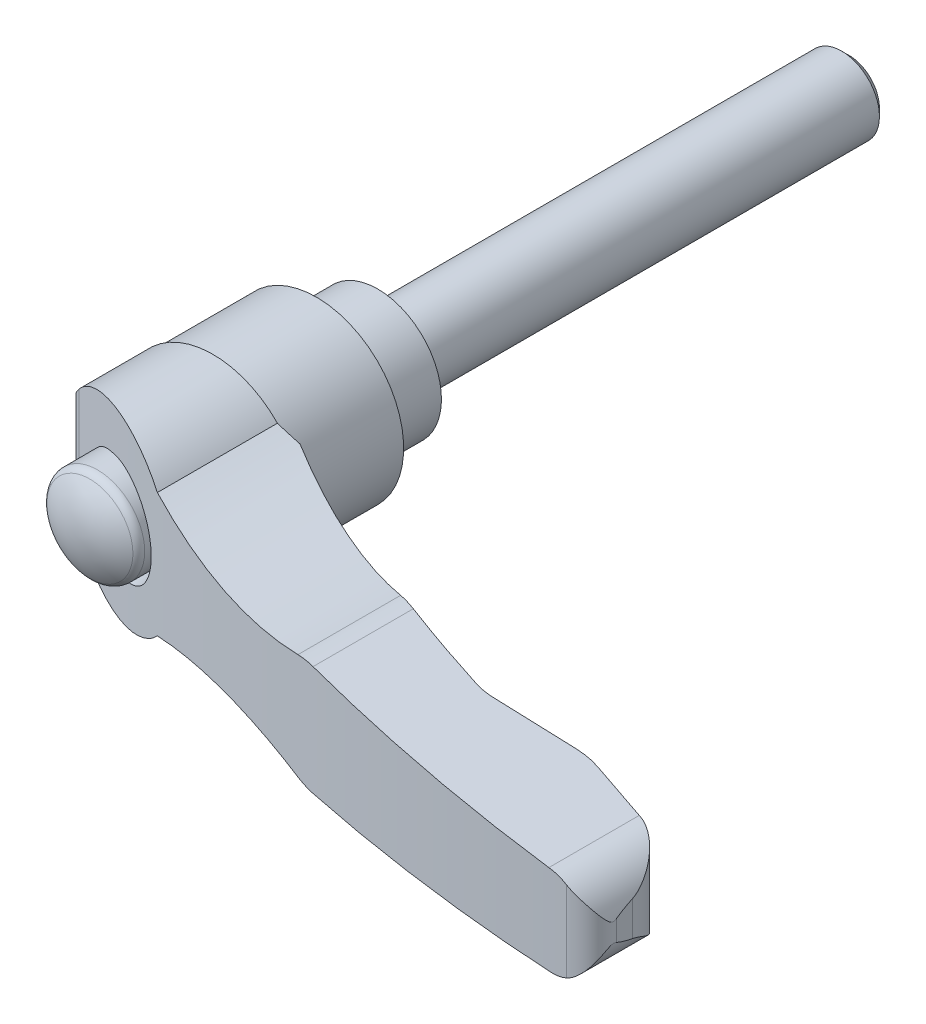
ISO-10303-21;
HEADER;
FILE_DESCRIPTION(('STEP AP214'),'2;1');
FILE_NAME('part.step','',(''),(''),'','','');
FILE_SCHEMA(('AUTOMOTIVE_DESIGN { 1 0 10303 214 1 1 1 1 }'));
ENDSEC;
DATA;
#1=APPLICATION_CONTEXT('core data for automotive mechanical design processes');
#2=APPLICATION_PROTOCOL_DEFINITION('international standard','automotive_design',2000,#1);
#3=PRODUCT_CONTEXT('',#1,'mechanical');
#4=PRODUCT('Part','Part','',(#3));
#5=PRODUCT_RELATED_PRODUCT_CATEGORY('part','',(#4));
#6=PRODUCT_DEFINITION_FORMATION('','',#4);
#7=PRODUCT_DEFINITION_CONTEXT('part definition',#1,'design');
#8=PRODUCT_DEFINITION('design','',#6,#7);
#9=PRODUCT_DEFINITION_SHAPE('','',#8);
#10=(LENGTH_UNIT() NAMED_UNIT(*) SI_UNIT(.MILLI.,.METRE.));
#11=(NAMED_UNIT(*) PLANE_ANGLE_UNIT() SI_UNIT($,.RADIAN.));
#12=(NAMED_UNIT(*) SI_UNIT($,.STERADIAN.) SOLID_ANGLE_UNIT());
#13=UNCERTAINTY_MEASURE_WITH_UNIT(LENGTH_MEASURE(1.E-05),#10,'distance_accuracy_value','');
#14=(GEOMETRIC_REPRESENTATION_CONTEXT(3) GLOBAL_UNCERTAINTY_ASSIGNED_CONTEXT((#13)) GLOBAL_UNIT_ASSIGNED_CONTEXT((#10,
#11,#12)) REPRESENTATION_CONTEXT('',''));
#15=CARTESIAN_POINT('',(0.,0.,0.));
#16=DIRECTION('',(0.,0.,1.));
#17=DIRECTION('',(1.,0.,0.));
#18=AXIS2_PLACEMENT_3D('',#15,#16,#17);
#19=CARTESIAN_POINT('',(0.,0.,-7.1165));
#20=DIRECTION('',(0.,0.,-1.));
#21=DIRECTION('',(0.,1.,0.));
#22=AXIS2_PLACEMENT_3D('',#19,#20,#21);
#23=CYLINDRICAL_SURFACE('',#22,4.);
#24=CARTESIAN_POINT('',(0.,0.,0.));
#25=DIRECTION('',(0.,0.,-1.));
#26=DIRECTION('',(0.,1.,0.));
#27=AXIS2_PLACEMENT_3D('',#24,#25,#26);
#28=CIRCLE('',#27,4.);
#29=CARTESIAN_POINT('',(0.,4.,0.));
#30=VERTEX_POINT('',#29);
#31=EDGE_CURVE('E17',#30,#30,#28,.F.);
#32=ORIENTED_EDGE('',*,*,#31,.F.);
#33=EDGE_LOOP('',(#32));
#34=FACE_BOUND('',#33,.T.);
#35=CARTESIAN_POINT('',(0.,0.,-49.2329999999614));
#36=DIRECTION('',(0.,0.,1.));
#37=DIRECTION('',(1.,0.,0.));
#38=AXIS2_PLACEMENT_3D('',#35,#36,#37);
#39=CIRCLE('',#38,4.);
#40=CARTESIAN_POINT('',(4.,0.,-49.2329999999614));
#41=VERTEX_POINT('',#40);
#42=EDGE_CURVE('E445',#41,#41,#39,.T.);
#43=ORIENTED_EDGE('',*,*,#42,.T.);
#44=EDGE_LOOP('',(#43));
#45=FACE_BOUND('',#44,.T.);
#46=ADVANCED_FACE('F14',(#34,#45),#23,.T.);
#47=CARTESIAN_POINT('',(5.375,0.,0.));
#48=DIRECTION('',(0.,0.,-1.));
#49=DIRECTION('',(0.,1.,0.));
#50=AXIS2_PLACEMENT_3D('',#47,#48,#49);
#51=PLANE('',#50);
#52=ORIENTED_EDGE('',*,*,#31,.T.);
#53=EDGE_LOOP('',(#52));
#54=FACE_BOUND('',#53,.T.);
#55=CARTESIAN_POINT('',(0.,0.,0.));
#56=DIRECTION('',(0.,0.,-1.));
#57=DIRECTION('',(0.,1.,0.));
#58=AXIS2_PLACEMENT_3D('',#55,#56,#57);
#59=CIRCLE('',#58,6.75);
#60=CARTESIAN_POINT('',(0.,6.75,0.));
#61=VERTEX_POINT('',#60);
#62=EDGE_CURVE('E194',#61,#61,#59,.F.);
#63=ORIENTED_EDGE('',*,*,#62,.F.);
#64=EDGE_LOOP('',(#63));
#65=FACE_BOUND('',#64,.T.);
#66=ADVANCED_FACE('F839',(#54,#65),#51,.T.);
#67=CARTESIAN_POINT('',(0.,0.,8.25));
#68=DIRECTION('',(0.,0.,-1.));
#69=DIRECTION('',(0.,1.,0.));
#70=AXIS2_PLACEMENT_3D('',#67,#68,#69);
#71=CYLINDRICAL_SURFACE('',#70,6.75);
#72=ORIENTED_EDGE('',*,*,#62,.T.);
#73=EDGE_LOOP('',(#72));
#74=FACE_BOUND('',#73,.T.);
#75=CARTESIAN_POINT('',(0.,0.,7.15000000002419));
#76=DIRECTION('',(0.,0.,-1.));
#77=DIRECTION('',(1.,0.,0.));
#78=AXIS2_PLACEMENT_3D('',#75,#76,#77);
#79=CIRCLE('',#78,6.74999999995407);
#80=CARTESIAN_POINT('',(6.74999999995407,0.,7.15000000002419));
#81=VERTEX_POINT('',#80);
#82=EDGE_CURVE('E192',#81,#81,#79,.T.);
#83=ORIENTED_EDGE('',*,*,#82,.T.);
#84=EDGE_LOOP('',(#83));
#85=FACE_BOUND('',#84,.T.);
#86=ADVANCED_FACE('F829',(#74,#85),#71,.T.);
#87=CARTESIAN_POINT('',(0.,0.,6.9000000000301));
#88=DIRECTION('',(0.,0.,-1.));
#89=DIRECTION('',(0.,1.,0.));
#90=AXIS2_PLACEMENT_3D('',#87,#88,#89);
#91=CONICAL_SURFACE('',#90,7.000000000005,0.785398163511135);
#92=ORIENTED_EDGE('',*,*,#82,.F.);
#93=EDGE_LOOP('',(#92));
#94=FACE_BOUND('',#93,.T.);
#95=CARTESIAN_POINT('',(0.,0.,6.9));
#96=DIRECTION('',(0.,0.,-1.));
#97=DIRECTION('',(0.,1.,0.));
#98=AXIS2_PLACEMENT_3D('',#95,#96,#97);
#99=CIRCLE('',#98,7.);
#100=CARTESIAN_POINT('',(0.,7.,6.9));
#101=VERTEX_POINT('',#100);
#102=EDGE_CURVE('E184',#101,#101,#99,.T.);
#103=ORIENTED_EDGE('',*,*,#102,.T.);
#104=EDGE_LOOP('',(#103));
#105=FACE_BOUND('',#104,.T.);
#106=ADVANCED_FACE('F819',(#94,#105),#91,.F.);
#107=CARTESIAN_POINT('',(0.,0.,6.2));
#108=DIRECTION('',(0.,0.,-1.));
#109=DIRECTION('',(0.,1.,0.));
#110=AXIS2_PLACEMENT_3D('',#107,#108,#109);
#111=CYLINDRICAL_SURFACE('',#110,7.);
#112=ORIENTED_EDGE('',*,*,#102,.F.);
#113=EDGE_LOOP('',(#112));
#114=FACE_BOUND('',#113,.T.);
#115=CARTESIAN_POINT('',(0.,0.,6.5));
#116=DIRECTION('',(0.,0.,-1.));
#117=DIRECTION('',(0.,1.,0.));
#118=AXIS2_PLACEMENT_3D('',#115,#116,#117);
#119=CIRCLE('',#118,7.);
#120=CARTESIAN_POINT('',(0.,7.,6.5));
#121=VERTEX_POINT('',#120);
#122=EDGE_CURVE('E181',#121,#121,#119,.F.);
#123=ORIENTED_EDGE('',*,*,#122,.F.);
#124=EDGE_LOOP('',(#123));
#125=FACE_BOUND('',#124,.T.);
#126=ADVANCED_FACE('F811',(#114,#125),#111,.F.);
#127=CARTESIAN_POINT('',(-9.01003775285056,-19.,6.5));
#128=DIRECTION('',(0.707106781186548,0.,0.707106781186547));
#129=DIRECTION('',(-0.707106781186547,0.,0.707106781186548));
#130=AXIS2_PLACEMENT_3D('',#127,#128,#129);
#131=PLANE('',#130);
#132=DIRECTION('',(0.,1.,0.));
#133=VECTOR('',#132,1.);
#134=CARTESIAN_POINT('',(-9.01003775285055,0.,6.5));
#135=LINE('',#134,#133);
#136=CARTESIAN_POINT('',(-9.01003775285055,-2.13584185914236,6.5));
#137=VERTEX_POINT('',#136);
#138=CARTESIAN_POINT('',(-9.01003775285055,2.13584185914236,6.5));
#139=VERTEX_POINT('',#138);
#140=EDGE_CURVE('E165',#137,#139,#135,.T.);
#141=ORIENTED_EDGE('',*,*,#140,.F.);
#142=CARTESIAN_POINT('',(-0.00999999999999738,0.,-2.50003775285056));
#143=DIRECTION('',(0.707106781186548,0.,0.707106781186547));
#144=DIRECTION('',(-0.707106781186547,0.,0.707106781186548));
#145=AXIS2_PLACEMENT_3D('',#142,#143,#144);
#146=ELLIPSE('',#145,13.0814754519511,9.25);
#147=EDGE_CURVE('E168',#139,#137,#146,.T.);
#148=ORIENTED_EDGE('',*,*,#147,.F.);
#149=EDGE_LOOP('',(#141,#148));
#150=FACE_BOUND('',#149,.T.);
#151=ADVANCED_FACE('F170',(#150),#131,.F.);
#152=CARTESIAN_POINT('',(-4.635,0.,6.5));
#153=DIRECTION('',(0.,0.,-1.));
#154=DIRECTION('',(0.,1.,0.));
#155=AXIS2_PLACEMENT_3D('',#152,#153,#154);
#156=PLANE('',#155);
#157=ORIENTED_EDGE('',*,*,#140,.T.);
#158=CARTESIAN_POINT('',(-0.00999999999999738,0.,6.5));
#159=DIRECTION('',(0.,0.,1.));
#160=DIRECTION('',(-1.,0.,0.));
#161=AXIS2_PLACEMENT_3D('',#158,#159,#160);
#162=CIRCLE('',#161,9.25);
#163=EDGE_CURVE('E172',#137,#139,#162,.T.);
#164=ORIENTED_EDGE('',*,*,#163,.F.);
#165=EDGE_LOOP('',(#157,#164));
#166=FACE_BOUND('',#165,.T.);
#167=ORIENTED_EDGE('',*,*,#122,.T.);
#168=EDGE_LOOP('',(#167));
#169=FACE_BOUND('',#168,.T.);
#170=ADVANCED_FACE('F179',(#166,#169),#156,.T.);
#171=CARTESIAN_POINT('',(-0.00999999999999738,0.,13.5625));
#172=DIRECTION('',(0.,0.,1.));
#173=DIRECTION('',(-1.,0.,0.));
#174=AXIS2_PLACEMENT_3D('',#171,#172,#173);
#175=CYLINDRICAL_SURFACE('',#174,9.25);
#176=ORIENTED_EDGE('',*,*,#163,.T.);
#177=ORIENTED_EDGE('',*,*,#147,.T.);
#178=EDGE_LOOP('',(#176,#177));
#179=FACE_BOUND('',#178,.T.);
#180=CARTESIAN_POINT('',(-0.00999999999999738,0.,17.5));
#181=DIRECTION('',(0.,0.,1.));
#182=DIRECTION('',(-1.,0.,0.));
#183=AXIS2_PLACEMENT_3D('',#180,#181,#182);
#184=CIRCLE('',#183,9.25);
#185=CARTESIAN_POINT('',(-9.26,0.,17.5));
#186=VERTEX_POINT('',#185);
#187=CARTESIAN_POINT('',(9.23999999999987,0.,17.5000000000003));
#188=VERTEX_POINT('',#187);
#189=EDGE_CURVE('E419',#186,#188,#184,.T.);
#190=ORIENTED_EDGE('',*,*,#189,.F.);
#191=CARTESIAN_POINT('',(-0.00999999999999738,0.,17.5));
#192=DIRECTION('',(0.,0.,1.));
#193=DIRECTION('',(-1.,0.,0.));
#194=AXIS2_PLACEMENT_3D('',#191,#192,#193);
#195=CIRCLE('',#194,9.25);
#196=EDGE_CURVE('E428',#188,#186,#195,.T.);
#197=ORIENTED_EDGE('',*,*,#196,.F.);
#198=EDGE_LOOP('',(#190,#197));
#199=FACE_BOUND('',#198,.T.);
#200=ADVANCED_FACE('F174',(#179,#199),#175,.T.);
#201=CARTESIAN_POINT('',(0.,0.,24.));
#202=DIRECTION('',(1.,0.,0.));
#203=DIRECTION('',(0.,0.,1.));
#204=AXIS2_PLACEMENT_3D('',#201,#202,#203);
#205=SPHERICAL_SURFACE('',#204,8.);
#206=CARTESIAN_POINT('',(0.,0.,30.5652144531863));
#207=DIRECTION('',(0.,0.,1.));
#208=DIRECTION('',(0.,-1.,0.));
#209=AXIS2_PLACEMENT_3D('',#206,#207,#208);
#210=CIRCLE('',#209,4.57142857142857);
#211=CARTESIAN_POINT('',(0.,-4.57142857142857,30.5652144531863));
#212=VERTEX_POINT('',#211);
#213=EDGE_CURVE('E403',#212,#212,#210,.F.);
#214=ORIENTED_EDGE('',*,*,#213,.F.);
#215=EDGE_LOOP('',(#214));
#216=FACE_BOUND('',#215,.T.);
#217=ADVANCED_FACE('F778',(#216),#205,.T.);
#218=CARTESIAN_POINT('',(64.6274051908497,-10.5,37.5817950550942));
#219=DIRECTION('',(0.992331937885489,0.,-0.123601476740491));
#220=DIRECTION('',(0.123601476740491,0.,0.992331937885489));
#221=AXIS2_PLACEMENT_3D('',#218,#219,#220);
#222=PLANE('',#221);
#223=CARTESIAN_POINT('',(60.25,0.,2.43788666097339));
#224=DIRECTION('',(0.992331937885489,0.,-0.123601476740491));
#225=DIRECTION('',(0.123601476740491,0.,0.992331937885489));
#226=AXIS2_PLACEMENT_3D('',#223,#224,#225);
#227=ELLIPSE('',#226,38.4299615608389,4.75);
#228=CARTESIAN_POINT('',(64.8745408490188,1.08449155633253,39.5659186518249));
#229=VERTEX_POINT('',#228);
#230=CARTESIAN_POINT('',(64.6274051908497,1.84413226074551,37.5817950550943));
#231=VERTEX_POINT('',#230);
#232=EDGE_CURVE('E555',#229,#231,#227,.F.);
#233=ORIENTED_EDGE('',*,*,#232,.F.);
#234=DIRECTION('',(0.,-1.,0.));
#235=VECTOR('',#234,1.);
#236=CARTESIAN_POINT('',(64.8745408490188,-10.5,39.5659186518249));
#237=LINE('',#236,#235);
#238=CARTESIAN_POINT('',(64.8745408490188,-1.08449155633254,39.5659186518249));
#239=VERTEX_POINT('',#238);
#240=EDGE_CURVE('E495',#239,#229,#237,.F.);
#241=ORIENTED_EDGE('',*,*,#240,.F.);
#242=CARTESIAN_POINT('',(60.25,0.,2.43788666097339));
#243=DIRECTION('',(0.992331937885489,0.,-0.123601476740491));
#244=DIRECTION('',(0.123601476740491,0.,0.992331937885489));
#245=AXIS2_PLACEMENT_3D('',#242,#243,#244);
#246=ELLIPSE('',#245,38.4299615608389,4.75);
#247=CARTESIAN_POINT('',(64.6274051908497,-1.84413226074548,37.5817950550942));
#248=VERTEX_POINT('',#247);
#249=EDGE_CURVE('E504',#248,#239,#246,.F.);
#250=ORIENTED_EDGE('',*,*,#249,.F.);
#251=DIRECTION('',(0.,-1.,0.));
#252=VECTOR('',#251,1.);
#253=CARTESIAN_POINT('',(64.6274051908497,-10.5,37.5817950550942));
#254=LINE('',#253,#252);
#255=EDGE_CURVE('E177',#231,#248,#254,.T.);
#256=ORIENTED_EDGE('',*,*,#255,.F.);
#257=EDGE_LOOP('',(#233,#241,#250,#256));
#258=FACE_BOUND('',#257,.T.);
#259=ADVANCED_FACE('F543',(#258),#222,.T.);
#260=CARTESIAN_POINT('',(58.6337202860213,-10.5,38.3283479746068));
#261=DIRECTION('',(0.,-1.,0.));
#262=DIRECTION('',(1.,0.,0.));
#263=AXIS2_PLACEMENT_3D('',#260,#261,#262);
#264=CYLINDRICAL_SURFACE('',#263,6.04);
#265=CARTESIAN_POINT('',(64.6274051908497,1.84413226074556,37.5817950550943));
#266=CARTESIAN_POINT('',(64.6175868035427,1.86745330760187,37.5030045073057));
#267=CARTESIAN_POINT('',(64.6063375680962,1.89362327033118,37.4253204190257));
#268=CARTESIAN_POINT('',(64.5811702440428,1.95049016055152,37.2721928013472));
#269=CARTESIAN_POINT('',(64.5672561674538,1.98118026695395,37.196746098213));
#270=CARTESIAN_POINT('',(64.5369883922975,2.04585034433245,37.0482136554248));
#271=CARTESIAN_POINT('',(64.520645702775,2.07981523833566,36.9751189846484));
#272=CARTESIAN_POINT('',(64.4855821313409,2.15032519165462,36.8307396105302));
#273=CARTESIAN_POINT('',(64.4668602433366,2.18687133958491,36.7594556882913));
#274=CARTESIAN_POINT('',(64.4072221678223,2.29938724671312,36.547961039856));
#275=CARTESIAN_POINT('',(64.3628565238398,2.37818379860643,36.410218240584));
#276=CARTESIAN_POINT('',(64.2652007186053,2.53960895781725,36.1400450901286));
#277=CARTESIAN_POINT('',(64.2118976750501,2.6222429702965,36.007622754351));
#278=CARTESIAN_POINT('',(64.077119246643,2.81672317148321,35.7040219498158));
#279=CARTESIAN_POINT('',(63.9921849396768,2.92909268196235,35.5347005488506));
#280=CARTESIAN_POINT('',(63.8063278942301,3.15216626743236,35.2039790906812));
#281=CARTESIAN_POINT('',(63.7054078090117,3.26287061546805,35.0425777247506));
#282=CARTESIAN_POINT('',(63.4870671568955,3.47959027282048,34.7278934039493));
#283=CARTESIAN_POINT('',(63.369645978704,3.58560540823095,34.5746107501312));
#284=CARTESIAN_POINT('',(63.1179209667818,3.7899652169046,34.277236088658));
#285=CARTESIAN_POINT('',(62.9836257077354,3.88831374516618,34.1331394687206));
#286=CARTESIAN_POINT('',(62.6561598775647,4.10136712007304,33.815313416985));
#287=CARTESIAN_POINT('',(62.4571888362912,4.2125890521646,33.6450495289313));
#288=CARTESIAN_POINT('',(62.1378586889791,4.36029911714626,33.4069452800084));
#289=CARTESIAN_POINT('',(62.0281124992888,4.40629516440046,33.330558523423));
#290=CARTESIAN_POINT('',(61.8018114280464,4.49098569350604,33.1841350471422));
#291=CARTESIAN_POINT('',(61.6852609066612,4.52968478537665,33.1140943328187));
#292=CARTESIAN_POINT('',(61.4786111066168,4.58924867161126,32.9993621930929));
#293=CARTESIAN_POINT('',(61.3900115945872,4.61209493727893,32.9529824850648));
#294=CARTESIAN_POINT('',(61.209734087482,4.65295056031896,32.8642982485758));
#295=CARTESIAN_POINT('',(61.1180570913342,4.67096147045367,32.82199241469));
#296=CARTESIAN_POINT('',(60.9313596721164,4.70183469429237,32.7415027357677));
#297=CARTESIAN_POINT('',(60.8363219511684,4.71466416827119,32.7033462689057));
#298=CARTESIAN_POINT('',(60.6438287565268,4.73463763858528,32.631712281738));
#299=CARTESIAN_POINT('',(60.5463713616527,4.74177695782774,32.5982386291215));
#300=CARTESIAN_POINT('',(60.4479724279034,4.74587261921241,32.5672639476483));
#301=B_SPLINE_CURVE_WITH_KNOTS('',3,(#265,#266,#267,#268,#269,#270,#271,#272,#273,#274,#275,
#276,#277,#278,#279,#280,#281,#282,#283,#284,#285,#286,#287,#288,#289,#290,#291,#292,#293,#294,
#295,#296,#297,#298,#299,#300),.UNSPECIFIED.,.F.,.F.,(4,2,2,2,2,2,2,2,2,2,2,2,2,2,2,2,2,4),(0.,
0.248076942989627,0.495783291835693,0.742399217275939,0.989119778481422,1.48293160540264,
1.97746142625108,2.63745339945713,3.29733594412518,3.95724294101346,4.61681594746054,
5.46693586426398,5.89075482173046,6.31430511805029,6.62183365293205,6.92926331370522,
7.23861197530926,7.54821464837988),.UNSPECIFIED.);
#302=CARTESIAN_POINT('',(60.4479724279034,4.74587261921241,32.5672639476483));
#303=VERTEX_POINT('',#302);
#304=EDGE_CURVE('E494',#231,#303,#301,.T.);
#305=ORIENTED_EDGE('',*,*,#304,.F.);
#306=ORIENTED_EDGE('',*,*,#255,.T.);
#307=CARTESIAN_POINT('',(60.4479724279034,-4.74587261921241,32.5672639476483));
#308=CARTESIAN_POINT('',(60.5755504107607,-4.74057354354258,32.6074069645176));
#309=CARTESIAN_POINT('',(60.7015088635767,-4.73014540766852,32.6517620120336));
#310=CARTESIAN_POINT('',(60.9490652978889,-4.69992242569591,32.7481786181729));
#311=CARTESIAN_POINT('',(61.0706698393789,-4.6801423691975,32.8002279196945));
#312=CARTESIAN_POINT('',(61.3074659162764,-4.63235500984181,32.9108206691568));
#313=CARTESIAN_POINT('',(61.4227141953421,-4.60444273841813,32.9692844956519));
#314=CARTESIAN_POINT('',(61.6477173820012,-4.54120548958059,33.0925213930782));
#315=CARTESIAN_POINT('',(61.7574696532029,-4.50587699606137,33.1572974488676));
#316=CARTESIAN_POINT('',(61.9940137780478,-4.42040174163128,33.307032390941));
#317=CARTESIAN_POINT('',(62.1193938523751,-4.36870213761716,33.3933358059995));
#318=CARTESIAN_POINT('',(62.3610721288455,-4.25718277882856,33.5732278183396));
#319=CARTESIAN_POINT('',(62.4773638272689,-4.19735729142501,33.6668215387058));
#320=CARTESIAN_POINT('',(62.7012840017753,-4.07066877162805,33.8608437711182));
#321=CARTESIAN_POINT('',(62.8088611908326,-4.00376876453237,33.9613071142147));
#322=CARTESIAN_POINT('',(63.0146476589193,-3.86453813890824,34.1677809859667));
#323=CARTESIAN_POINT('',(63.1128596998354,-3.79220913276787,34.2737898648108));
#324=CARTESIAN_POINT('',(63.3331746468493,-3.6170051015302,34.5290929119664));
#325=CARTESIAN_POINT('',(63.4514763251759,-3.51235864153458,34.6804594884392));
#326=CARTESIAN_POINT('',(63.6718053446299,-3.29808480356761,34.9913387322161));
#327=CARTESIAN_POINT('',(63.7738256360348,-3.18845529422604,35.1508548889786));
#328=CARTESIAN_POINT('',(63.961662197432,-2.96765680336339,35.4770445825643));
#329=CARTESIAN_POINT('',(64.0475378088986,-2.85649513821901,35.6436890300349));
#330=CARTESIAN_POINT('',(64.2038484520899,-2.63586419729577,35.9851508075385));
#331=CARTESIAN_POINT('',(64.2742871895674,-2.52639452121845,36.1599661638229));
#332=CARTESIAN_POINT('',(64.3705847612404,-2.36382517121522,36.4361542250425));
#333=CARTESIAN_POINT('',(64.4019853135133,-2.30809068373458,36.5340606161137));
#334=CARTESIAN_POINT('',(64.4601539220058,-2.20019362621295,36.7330390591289));
#335=CARTESIAN_POINT('',(64.4869269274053,-2.14802727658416,36.8341075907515));
#336=CARTESIAN_POINT('',(64.5357331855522,-2.0489078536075,37.0402846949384));
#337=CARTESIAN_POINT('',(64.5577546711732,-2.00196785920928,37.1454025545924));
#338=CARTESIAN_POINT('',(64.5966140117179,-1.91618262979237,37.360168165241));
#339=CARTESIAN_POINT('',(64.6134353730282,-1.87736327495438,37.4698291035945));
#340=CARTESIAN_POINT('',(64.6274051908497,-1.84413226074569,37.5817950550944));
#341=B_SPLINE_CURVE_WITH_KNOTS('',3,(#307,#308,#309,#310,#311,#312,#313,#314,#315,#316,#317,
#318,#319,#320,#321,#322,#323,#324,#325,#326,#327,#328,#329,#330,#331,#332,#333,#334,#335,#336,
#337,#338,#339,#340),.UNSPECIFIED.,.F.,.F.,(4,2,2,2,2,2,2,2,2,2,2,2,2,2,2,2,4),(0.,
0.401264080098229,0.801895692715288,1.19802151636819,1.5943355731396,2.07588331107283,
2.55777255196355,3.04231807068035,3.52672024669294,4.18208013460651,4.83772302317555,
5.49090678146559,6.14393356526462,6.4946438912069,6.84497677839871,7.19616755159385,
7.54846105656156),.UNSPECIFIED.);
#342=CARTESIAN_POINT('',(60.4479724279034,-4.74587261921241,32.5672639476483));
#343=VERTEX_POINT('',#342);
#344=EDGE_CURVE('E507',#343,#248,#341,.T.);
#345=ORIENTED_EDGE('',*,*,#344,.F.);
#346=DIRECTION('',(0.,-1.,0.));
#347=VECTOR('',#346,1.);
#348=CARTESIAN_POINT('',(60.4479724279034,-10.5,32.5672639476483));
#349=LINE('',#348,#347);
#350=EDGE_CURVE('E417',#303,#343,#349,.T.);
#351=ORIENTED_EDGE('',*,*,#350,.F.);
#352=EDGE_LOOP('',(#305,#306,#345,#351));
#353=FACE_BOUND('',#352,.T.);
#354=ADVANCED_FACE('F537',(#353),#264,.T.);
#355=CARTESIAN_POINT('',(-9.26,-10.5,17.5));
#356=DIRECTION('',(0.,0.,-1.));
#357=DIRECTION('',(0.,1.,0.));
#358=AXIS2_PLACEMENT_3D('',#355,#356,#357);
#359=PLANE('',#358);
#360=DIRECTION('',(0.,-1.,0.));
#361=VECTOR('',#360,1.);
#362=CARTESIAN_POINT('',(-9.26,-10.5,17.5));
#363=LINE('',#362,#361);
#364=CARTESIAN_POINT('',(-9.26,2.12188595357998,17.5));
#365=VERTEX_POINT('',#364);
#366=EDGE_CURVE('E426',#365,#186,#363,.T.);
#367=ORIENTED_EDGE('',*,*,#366,.F.);
#368=CARTESIAN_POINT('',(0.,0.,17.5));
#369=DIRECTION('',(0.,0.,1.));
#370=DIRECTION('',(0.,-1.,0.));
#371=AXIS2_PLACEMENT_3D('',#368,#369,#370);
#372=CIRCLE('',#371,9.5);
#373=CARTESIAN_POINT('',(6.8437408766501,6.58887022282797,17.5));
#374=VERTEX_POINT('',#373);
#375=EDGE_CURVE('E340',#374,#365,#372,.T.);
#376=ORIENTED_EDGE('',*,*,#375,.F.);
#377=CARTESIAN_POINT('',(19.25,44.09,17.5));
#378=DIRECTION('',(0.,0.,1.));
#379=DIRECTION('',(0.,-1.,0.));
#380=AXIS2_PLACEMENT_3D('',#377,#378,#379);
#381=CIRCLE('',#380,39.5);
#382=CARTESIAN_POINT('',(9.23999999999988,5.8794006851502,17.5000000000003));
#383=VERTEX_POINT('',#382);
#384=EDGE_CURVE('E300',#374,#383,#381,.T.);
#385=ORIENTED_EDGE('',*,*,#384,.T.);
#386=DIRECTION('',(0.,-1.,0.));
#387=VECTOR('',#386,1.);
#388=CARTESIAN_POINT('',(9.23999999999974,-10.5,17.5000000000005));
#389=LINE('',#388,#387);
#390=EDGE_CURVE('E406',#383,#188,#389,.T.);
#391=ORIENTED_EDGE('',*,*,#390,.T.);
#392=ORIENTED_EDGE('',*,*,#196,.T.);
#393=EDGE_LOOP('',(#367,#376,#385,#391,#392));
#394=FACE_BOUND('',#393,.T.);
#395=ADVANCED_FACE('F542',(#394),#359,.T.);
#396=CARTESIAN_POINT('',(-9.26,-10.5,21.2038249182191));
#397=DIRECTION('',(-1.,0.,0.));
#398=DIRECTION('',(0.,-1.,0.));
#399=AXIS2_PLACEMENT_3D('',#396,#397,#398);
#400=PLANE('',#399);
#401=ORIENTED_EDGE('',*,*,#366,.T.);
#402=DIRECTION('',(0.,1.,0.));
#403=VECTOR('',#402,1.);
#404=CARTESIAN_POINT('',(-9.26,-10.5,17.5));
#405=LINE('',#404,#403);
#406=CARTESIAN_POINT('',(-9.26,-2.12188595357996,17.5));
#407=VERTEX_POINT('',#406);
#408=EDGE_CURVE('E420',#407,#186,#405,.T.);
#409=ORIENTED_EDGE('',*,*,#408,.F.);
#410=DIRECTION('',(0.,0.,1.));
#411=VECTOR('',#410,1.);
#412=CARTESIAN_POINT('',(-9.26,-2.12188595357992,42.5));
#413=LINE('',#412,#411);
#414=CARTESIAN_POINT('',(-9.26,-2.12188595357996,21.2038249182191));
#415=VERTEX_POINT('',#414);
#416=EDGE_CURVE('E423',#415,#407,#413,.F.);
#417=ORIENTED_EDGE('',*,*,#416,.F.);
#418=DIRECTION('',(0.,-1.,0.));
#419=VECTOR('',#418,1.);
#420=CARTESIAN_POINT('',(-9.26,-10.5,21.2038249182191));
#421=LINE('',#420,#419);
#422=CARTESIAN_POINT('',(-9.26,2.12188595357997,21.2038249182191));
#423=VERTEX_POINT('',#422);
#424=EDGE_CURVE('E475',#423,#415,#421,.T.);
#425=ORIENTED_EDGE('',*,*,#424,.F.);
#426=DIRECTION('',(0.,0.,1.));
#427=VECTOR('',#426,1.);
#428=CARTESIAN_POINT('',(-9.26,2.12188595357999,42.5));
#429=LINE('',#428,#427);
#430=EDGE_CURVE('E343',#365,#423,#429,.T.);
#431=ORIENTED_EDGE('',*,*,#430,.F.);
#432=EDGE_LOOP('',(#401,#409,#417,#425,#431));
#433=FACE_BOUND('',#432,.T.);
#434=ADVANCED_FACE('F740',(#433),#400,.T.);
#435=CARTESIAN_POINT('',(-9.26,-10.5,17.5));
#436=DIRECTION('',(0.,0.,-1.));
#437=DIRECTION('',(0.,1.,0.));
#438=AXIS2_PLACEMENT_3D('',#435,#436,#437);
#439=PLANE('',#438);
#440=DIRECTION('',(0.,-1.,0.));
#441=VECTOR('',#440,1.);
#442=CARTESIAN_POINT('',(9.23999999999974,-10.5,17.5000000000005));
#443=LINE('',#442,#441);
#444=CARTESIAN_POINT('',(9.23999999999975,-5.87940068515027,17.5000000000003));
#445=VERTEX_POINT('',#444);
#446=EDGE_CURVE('E404',#188,#445,#443,.T.);
#447=ORIENTED_EDGE('',*,*,#446,.T.);
#448=CARTESIAN_POINT('',(19.25,-44.09,17.5));
#449=DIRECTION('',(0.,0.,1.));
#450=DIRECTION('',(0.,-1.,0.));
#451=AXIS2_PLACEMENT_3D('',#448,#449,#450);
#452=CIRCLE('',#451,39.5);
#453=CARTESIAN_POINT('',(6.84374087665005,-6.588870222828,17.5));
#454=VERTEX_POINT('',#453);
#455=EDGE_CURVE('E474',#445,#454,#452,.T.);
#456=ORIENTED_EDGE('',*,*,#455,.T.);
#457=CARTESIAN_POINT('',(0.,0.,17.5));
#458=DIRECTION('',(0.,0.,1.));
#459=DIRECTION('',(0.,-1.,0.));
#460=AXIS2_PLACEMENT_3D('',#457,#458,#459);
#461=CIRCLE('',#460,9.5);
#462=EDGE_CURVE('E478',#407,#454,#461,.T.);
#463=ORIENTED_EDGE('',*,*,#462,.F.);
#464=ORIENTED_EDGE('',*,*,#408,.T.);
#465=ORIENTED_EDGE('',*,*,#189,.T.);
#466=EDGE_LOOP('',(#447,#456,#463,#464,#465));
#467=FACE_BOUND('',#466,.T.);
#468=ADVANCED_FACE('F732',(#467),#439,.T.);
#469=CARTESIAN_POINT('',(53.8294507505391,-10.5,30.4829917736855));
#470=DIRECTION('',(0.300372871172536,0.,-0.953821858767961));
#471=DIRECTION('',(0.953821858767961,0.,0.300372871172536));
#472=AXIS2_PLACEMENT_3D('',#469,#470,#471);
#473=PLANE('',#472);
#474=CARTESIAN_POINT('',(60.25,0.,32.5049194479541));
#475=DIRECTION('',(0.300372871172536,0.,-0.953821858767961));
#476=DIRECTION('',(0.953821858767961,0.,0.300372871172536));
#477=AXIS2_PLACEMENT_3D('',#474,#475,#476);
#478=ELLIPSE('',#477,4.97996555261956,4.75);
#479=CARTESIAN_POINT('',(60.25,4.75,32.5049194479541));
#480=VERTEX_POINT('',#479);
#481=EDGE_CURVE('E496',#303,#480,#478,.F.);
#482=ORIENTED_EDGE('',*,*,#481,.F.);
#483=ORIENTED_EDGE('',*,*,#350,.T.);
#484=CARTESIAN_POINT('',(60.25,0.,32.5049194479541));
#485=DIRECTION('',(0.300372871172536,0.,-0.953821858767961));
#486=DIRECTION('',(0.953821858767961,0.,0.300372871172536));
#487=AXIS2_PLACEMENT_3D('',#484,#485,#486);
#488=ELLIPSE('',#487,4.97996555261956,4.75);
#489=CARTESIAN_POINT('',(60.25,-4.75,32.5049194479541));
#490=VERTEX_POINT('',#489);
#491=EDGE_CURVE('E536',#490,#343,#488,.F.);
#492=ORIENTED_EDGE('',*,*,#491,.F.);
#493=DIRECTION('',(-0.953255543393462,-0.0344545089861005,-0.300194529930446));
#494=VECTOR('',#493,1.);
#495=CARTESIAN_POINT('',(60.25,-4.75,32.5049194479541));
#496=LINE('',#495,#494);
#497=CARTESIAN_POINT('',(53.8294507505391,-4.98206460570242,30.4829917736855));
#498=VERTEX_POINT('',#497);
#499=EDGE_CURVE('E464',#490,#498,#496,.T.);
#500=ORIENTED_EDGE('',*,*,#499,.T.);
#501=DIRECTION('',(0.,-1.,0.));
#502=VECTOR('',#501,1.);
#503=CARTESIAN_POINT('',(53.8294507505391,-10.5,30.4829917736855));
#504=LINE('',#503,#502);
#505=CARTESIAN_POINT('',(53.8294507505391,4.98206460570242,30.4829917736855));
#506=VERTEX_POINT('',#505);
#507=EDGE_CURVE('E414',#506,#498,#504,.T.);
#508=ORIENTED_EDGE('',*,*,#507,.F.);
#509=DIRECTION('',(0.953255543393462,-0.0344545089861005,0.300194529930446));
#510=VECTOR('',#509,1.);
#511=CARTESIAN_POINT('',(53.8294507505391,4.98206460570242,30.4829917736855));
#512=LINE('',#511,#510);
#513=EDGE_CURVE('E299',#506,#480,#512,.T.);
#514=ORIENTED_EDGE('',*,*,#513,.T.);
#515=EDGE_LOOP('',(#482,#483,#492,#500,#508,#514));
#516=FACE_BOUND('',#515,.T.);
#517=ADVANCED_FACE('F573',(#516),#473,.T.);
#518=CARTESIAN_POINT('',(51.0780352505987,-10.5,39.22));
#519=DIRECTION('',(0.,-1.,0.));
#520=DIRECTION('',(1.,0.,0.));
#521=AXIS2_PLACEMENT_3D('',#518,#519,#520);
#522=CYLINDRICAL_SURFACE('',#521,9.15999999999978);
#523=CARTESIAN_POINT('',(51.0780352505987,5.08151188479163,39.22));
#524=DIRECTION('',(-0.0361204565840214,-0.999347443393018,0.));
#525=DIRECTION('',(0.999347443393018,-0.0361204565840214,0.));
#526=AXIS2_PLACEMENT_3D('',#523,#524,#525);
#527=ELLIPSE('',#526,9.16598132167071,9.15999999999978);
#528=CARTESIAN_POINT('',(51.0780352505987,5.08151188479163,30.06));
#529=VERTEX_POINT('',#528);
#530=EDGE_CURVE('E302',#529,#506,#527,.T.);
#531=ORIENTED_EDGE('',*,*,#530,.T.);
#532=ORIENTED_EDGE('',*,*,#507,.T.);
#533=CARTESIAN_POINT('',(51.0780352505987,-5.08151188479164,39.22));
#534=DIRECTION('',(-0.0361204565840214,0.999347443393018,0.));
#535=DIRECTION('',(-0.999347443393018,-0.0361204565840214,0.));
#536=AXIS2_PLACEMENT_3D('',#533,#534,#535);
#537=ELLIPSE('',#536,9.16598132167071,9.15999999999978);
#538=CARTESIAN_POINT('',(51.0780352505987,-5.08151188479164,30.06));
#539=VERTEX_POINT('',#538);
#540=EDGE_CURVE('E463',#498,#539,#537,.T.);
#541=ORIENTED_EDGE('',*,*,#540,.T.);
#542=DIRECTION('',(0.,1.,0.));
#543=VECTOR('',#542,1.);
#544=CARTESIAN_POINT('',(51.0780352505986,-10.5,30.06));
#545=LINE('',#544,#543);
#546=EDGE_CURVE('E411',#529,#539,#545,.F.);
#547=ORIENTED_EDGE('',*,*,#546,.F.);
#548=EDGE_LOOP('',(#531,#532,#541,#547));
#549=FACE_BOUND('',#548,.T.);
#550=ADVANCED_FACE('F716',(#549),#522,.T.);
#551=CARTESIAN_POINT('',(42.239481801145,-10.5,30.06));
#552=DIRECTION('',(0.,0.,-1.));
#553=DIRECTION('',(0.,1.,0.));
#554=AXIS2_PLACEMENT_3D('',#551,#552,#553);
#555=PLANE('',#554);
#556=DIRECTION('',(0.999347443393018,-0.0361204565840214,0.));
#557=VECTOR('',#556,1.);
#558=CARTESIAN_POINT('',(30.3472861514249,5.83080496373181,30.06));
#559=LINE('',#558,#557);
#560=CARTESIAN_POINT('',(42.239481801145,5.4009729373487,30.06));
#561=VERTEX_POINT('',#560);
#562=EDGE_CURVE('E488',#561,#529,#559,.T.);
#563=ORIENTED_EDGE('',*,*,#562,.T.);
#564=ORIENTED_EDGE('',*,*,#546,.T.);
#565=DIRECTION('',(-0.999347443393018,-0.0361204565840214,0.));
#566=VECTOR('',#565,1.);
#567=CARTESIAN_POINT('',(60.25,-4.75,30.06));
#568=LINE('',#567,#566);
#569=CARTESIAN_POINT('',(42.239481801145,-5.4009729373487,30.06));
#570=VERTEX_POINT('',#569);
#571=EDGE_CURVE('E460',#539,#570,#568,.T.);
#572=ORIENTED_EDGE('',*,*,#571,.T.);
#573=DIRECTION('',(0.,-1.,0.));
#574=VECTOR('',#573,1.);
#575=CARTESIAN_POINT('',(42.239481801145,-10.5,30.06));
#576=LINE('',#575,#574);
#577=EDGE_CURVE('E409',#570,#561,#576,.F.);
#578=ORIENTED_EDGE('',*,*,#577,.T.);
#579=EDGE_LOOP('',(#563,#564,#572,#578));
#580=FACE_BOUND('',#579,.T.);
#581=ADVANCED_FACE('F708',(#580),#555,.T.);
#582=CARTESIAN_POINT('',(42.2394818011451,-10.5,23.0799999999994));
#583=DIRECTION('',(0.,-1.,0.));
#584=DIRECTION('',(1.,0.,0.));
#585=AXIS2_PLACEMENT_3D('',#582,#583,#584);
#586=CYLINDRICAL_SURFACE('',#585,6.98000000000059);
#587=DIRECTION('',(0.,-1.,0.));
#588=VECTOR('',#587,1.);
#589=CARTESIAN_POINT('',(40.3024609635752,-10.5,29.785844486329));
#590=LINE('',#589,#588);
#591=CARTESIAN_POINT('',(40.3024609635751,-5.47098470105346,29.7858444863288));
#592=VERTEX_POINT('',#591);
#593=CARTESIAN_POINT('',(40.3024609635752,5.47098470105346,29.7858444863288));
#594=VERTEX_POINT('',#593);
#595=EDGE_CURVE('E401',#592,#594,#590,.F.);
#596=ORIENTED_EDGE('',*,*,#595,.T.);
#597=CARTESIAN_POINT('',(42.2394818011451,5.40097293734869,23.0799999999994));
#598=DIRECTION('',(-0.0361204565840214,-0.999347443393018,0.));
#599=DIRECTION('',(0.999347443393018,-0.0361204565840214,0.));
#600=AXIS2_PLACEMENT_3D('',#597,#598,#599);
#601=ELLIPSE('',#600,6.98455781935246,6.98000000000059);
#602=EDGE_CURVE('E491',#594,#561,#601,.F.);
#603=ORIENTED_EDGE('',*,*,#602,.T.);
#604=ORIENTED_EDGE('',*,*,#577,.F.);
#605=CARTESIAN_POINT('',(42.2394818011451,-5.4009729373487,23.0799999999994));
#606=DIRECTION('',(-0.0361204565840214,0.999347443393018,0.));
#607=DIRECTION('',(-0.999347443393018,-0.0361204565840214,0.));
#608=AXIS2_PLACEMENT_3D('',#605,#606,#607);
#609=ELLIPSE('',#608,6.98455781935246,6.98000000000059);
#610=EDGE_CURVE('E462',#570,#592,#609,.F.);
#611=ORIENTED_EDGE('',*,*,#610,.T.);
#612=EDGE_LOOP('',(#596,#603,#604,#611));
#613=FACE_BOUND('',#612,.T.);
#614=ADVANCED_FACE('F310',(#613),#586,.F.);
#615=CARTESIAN_POINT('',(88.9416647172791,-10.5,-138.600024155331));
#616=DIRECTION('',(0.,-1.,0.));
#617=DIRECTION('',(1.,0.,0.));
#618=AXIS2_PLACEMENT_3D('',#615,#616,#617);
#619=CYLINDRICAL_SURFACE('',#618,175.27);
#620=CARTESIAN_POINT('',(30.3472861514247,5.83080496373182,26.5855433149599));
#621=CARTESIAN_POINT('',(30.1696679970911,5.83722947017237,26.5225405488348));
#622=CARTESIAN_POINT('',(29.9919650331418,5.83772087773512,26.45918181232));
#623=CARTESIAN_POINT('',(29.6377732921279,5.82691956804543,26.3322542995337));
#624=CARTESIAN_POINT('',(29.461282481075,5.81567269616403,26.2686872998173));
#625=CARTESIAN_POINT('',(29.1095062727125,5.78152581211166,26.1413510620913));
#626=CARTESIAN_POINT('',(28.9342208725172,5.75862582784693,26.0775818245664));
#627=CARTESIAN_POINT('',(28.5848474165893,5.70116062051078,25.9498538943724));
#628=CARTESIAN_POINT('',(28.4107667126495,5.6665501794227,25.8858954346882));
#629=CARTESIAN_POINT('',(28.2379732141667,5.62616845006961,25.8220994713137));
#630=B_SPLINE_CURVE_WITH_KNOTS('',3,(#620,#621,#622,#623,#624,#625,#626,#627,#628,#629),
.UNSPECIFIED.,.F.,.F.,(4,2,2,2,4),(0.,0.565613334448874,1.1290258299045,1.69243697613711,
2.2580489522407),.UNSPECIFIED.);
#631=CARTESIAN_POINT('',(30.3472861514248,5.83080496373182,26.5855433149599));
#632=VERTEX_POINT('',#631);
#633=CARTESIAN_POINT('',(28.2379732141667,5.62616845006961,25.8220994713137));
#634=VERTEX_POINT('',#633);
#635=EDGE_CURVE('E290',#632,#634,#630,.T.);
#636=ORIENTED_EDGE('',*,*,#635,.F.);
#637=CARTESIAN_POINT('',(88.9416647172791,3.71296724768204,-138.600024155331));
#638=DIRECTION('',(-0.0361204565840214,-0.999347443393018,0.));
#639=DIRECTION('',(0.999347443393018,-0.0361204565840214,0.));
#640=AXIS2_PLACEMENT_3D('',#637,#638,#639);
#641=ELLIPSE('',#640,175.384448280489,175.27);
#642=EDGE_CURVE('E493',#632,#594,#641,.F.);
#643=ORIENTED_EDGE('',*,*,#642,.T.);
#644=ORIENTED_EDGE('',*,*,#595,.F.);
#645=CARTESIAN_POINT('',(88.9416647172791,-3.71296724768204,-138.600024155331));
#646=DIRECTION('',(-0.0361204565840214,0.999347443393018,0.));
#647=DIRECTION('',(-0.999347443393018,-0.0361204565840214,0.));
#648=AXIS2_PLACEMENT_3D('',#645,#646,#647);
#649=ELLIPSE('',#648,175.384448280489,175.27);
#650=CARTESIAN_POINT('',(30.3472861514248,-5.83080496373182,26.5855433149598));
#651=VERTEX_POINT('',#650);
#652=EDGE_CURVE('E396',#592,#651,#649,.F.);
#653=ORIENTED_EDGE('',*,*,#652,.T.);
#654=CARTESIAN_POINT('',(28.237973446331,-5.6261685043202,25.8220995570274));
#655=CARTESIAN_POINT('',(28.4107669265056,-5.66655022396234,25.8858955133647));
#656=CARTESIAN_POINT('',(28.584847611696,-5.70116065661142,25.9498539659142));
#657=CARTESIAN_POINT('',(28.9342210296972,-5.75862584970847,26.0775818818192));
#658=CARTESIAN_POINT('',(29.1095064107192,-5.78152582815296,26.1413511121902));
#659=CARTESIAN_POINT('',(29.461282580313,-5.81567270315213,26.2686873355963));
#660=CARTESIAN_POINT('',(29.6377733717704,-5.82691957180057,26.3322543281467));
#661=CARTESIAN_POINT('',(29.9919650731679,-5.83772087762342,26.4591818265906));
#662=CARTESIAN_POINT('',(30.169668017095,-5.83722946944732,26.5225405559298));
#663=CARTESIAN_POINT('',(30.3472861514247,-5.83080496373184,26.5855433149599));
#664=B_SPLINE_CURVE_WITH_KNOTS('',3,(#654,#655,#656,#657,#658,#659,#660,#661,#662,#663),
.UNSPECIFIED.,.F.,.F.,(4,2,2,2,4),(0.,0.565611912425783,1.12902299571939,1.69243542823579,
2.25804869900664),.UNSPECIFIED.);
#665=CARTESIAN_POINT('',(28.237973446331,-5.6261685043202,25.8220995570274));
#666=VERTEX_POINT('',#665);
#667=EDGE_CURVE('E327',#666,#651,#664,.T.);
#668=ORIENTED_EDGE('',*,*,#667,.F.);
#669=CARTESIAN_POINT('',(28.237973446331,-5.6261685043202,25.8220995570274));
#670=CARTESIAN_POINT('',(27.6467124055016,-5.48799745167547,25.6038196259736));
#671=CARTESIAN_POINT('',(27.0537779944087,-5.3638308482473,25.3812778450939));
#672=CARTESIAN_POINT('',(25.8659006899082,-5.14331117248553,24.9280288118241));
#673=CARTESIAN_POINT('',(25.2709579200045,-5.04695642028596,24.6973220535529));
#674=CARTESIAN_POINT('',(24.0803912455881,-4.88185687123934,24.2280988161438));
#675=CARTESIAN_POINT('',(23.4847674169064,-4.81310925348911,23.9895831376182));
#676=CARTESIAN_POINT('',(22.2940534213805,-4.70292970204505,23.5051335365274));
#677=CARTESIAN_POINT('',(21.6989632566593,-4.66149787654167,23.2591995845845));
#678=CARTESIAN_POINT('',(19.93823636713,-4.57874286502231,22.520112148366));
#679=CARTESIAN_POINT('',(18.7748149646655,-4.57591682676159,22.0168726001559));
#680=CARTESIAN_POINT('',(16.4631439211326,-4.67145944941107,20.9870607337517));
#681=CARTESIAN_POINT('',(15.3148886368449,-4.76978933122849,20.4604974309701));
#682=CARTESIAN_POINT('',(13.7610005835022,-4.97097993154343,19.7276539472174));
#683=CARTESIAN_POINT('',(13.3455946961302,-5.03153416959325,19.5297267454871));
#684=CARTESIAN_POINT('',(12.518128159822,-5.16561835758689,19.1314774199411));
#685=CARTESIAN_POINT('',(12.1060667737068,-5.23914536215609,18.9311558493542));
#686=CARTESIAN_POINT('',(11.282699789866,-5.39957122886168,18.526898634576));
#687=CARTESIAN_POINT('',(10.8714191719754,-5.48655913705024,18.3229475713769));
#688=CARTESIAN_POINT('',(10.0527171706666,-5.67338492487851,17.9129677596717));
#689=CARTESIAN_POINT('',(9.64529662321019,-5.77322552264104,17.7069385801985));
#690=CARTESIAN_POINT('',(9.23999999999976,-5.87940068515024,17.5000000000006));
#691=B_SPLINE_CURVE_WITH_KNOTS('',3,(#669,#670,#671,#672,#673,#674,#675,#676,#677,#678,#679,
#680,#681,#682,#683,#684,#685,#686,#687,#688,#689,#690),.UNSPECIFIED.,.F.,.F.,(4,2,2,2,2,2,2,2,
2,2,4),(0.,1.93549726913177,3.87087760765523,5.80606013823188,7.74125033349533,11.5393004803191,
15.3358951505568,16.7281050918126,18.1199993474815,19.5215293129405,20.9233561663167),.UNSPECIFIED.);
#692=EDGE_CURVE('E318',#666,#445,#691,.T.);
#693=ORIENTED_EDGE('',*,*,#692,.T.);
#694=ORIENTED_EDGE('',*,*,#446,.F.);
#695=ORIENTED_EDGE('',*,*,#390,.F.);
#696=CARTESIAN_POINT('',(9.23999999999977,5.87940068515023,17.5000000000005));
#697=CARTESIAN_POINT('',(9.79948003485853,5.73283344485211,17.7856672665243));
#698=CARTESIAN_POINT('',(10.363016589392,5.59833643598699,18.0695987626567));
#699=CARTESIAN_POINT('',(11.4974282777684,5.35391463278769,18.6334448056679));
#700=CARTESIAN_POINT('',(12.068303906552,5.24399150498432,18.9133590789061));
#701=CARTESIAN_POINT('',(13.2171050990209,5.04907387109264,19.4688580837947));
#702=CARTESIAN_POINT('',(13.795037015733,4.9641038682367,19.7444383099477));
#703=CARTESIAN_POINT('',(14.9564491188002,4.81968144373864,20.2904183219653));
#704=CARTESIAN_POINT('',(15.5399291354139,4.7602282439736,20.56081826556));
#705=CARTESIAN_POINT('',(17.2745449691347,4.62260622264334,21.3530632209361));
#706=CARTESIAN_POINT('',(18.4324989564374,4.58133087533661,21.8669029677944));
#707=CARTESIAN_POINT('',(20.7578250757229,4.60168529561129,22.8686662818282));
#708=CARTESIAN_POINT('',(21.9251896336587,4.66323920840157,23.3566086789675));
#709=CARTESIAN_POINT('',(23.5210667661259,4.81923174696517,24.0035807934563));
#710=CARTESIAN_POINT('',(23.9492706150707,4.86815261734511,24.1752006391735));
#711=CARTESIAN_POINT('',(24.8053597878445,4.98022825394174,24.5144113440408));
#712=CARTESIAN_POINT('',(25.2332451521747,5.04338070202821,24.6820028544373));
#713=CARTESIAN_POINT('',(26.0913485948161,5.18451987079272,25.01422907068));
#714=CARTESIAN_POINT('',(26.5215612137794,5.26261039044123,25.1788336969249));
#715=CARTESIAN_POINT('',(27.3808010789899,5.43340909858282,25.5037362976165));
#716=CARTESIAN_POINT('',(27.8098280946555,5.52611995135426,25.6640334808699));
#717=CARTESIAN_POINT('',(28.2379732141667,5.6261684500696,25.8220994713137));
#718=B_SPLINE_CURVE_WITH_KNOTS('',3,(#696,#697,#698,#699,#700,#701,#702,#703,#704,#705,#706,
#707,#708,#709,#710,#711,#712,#713,#714,#715,#716,#717),.UNSPECIFIED.,.F.,.F.,(4,2,2,2,2,2,2,2,
2,2,4),(0.,1.93506781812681,3.87026682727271,5.80735983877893,7.74439377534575,11.5423680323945,
15.3375418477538,16.7290777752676,18.1203872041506,19.5217406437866,20.9233497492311),.UNSPECIFIED.);
#719=EDGE_CURVE('E333',#383,#634,#718,.T.);
#720=ORIENTED_EDGE('',*,*,#719,.T.);
#721=EDGE_LOOP('',(#636,#643,#644,#653,#668,#693,#694,#695,#720));
#722=FACE_BOUND('',#721,.T.);
#723=ADVANCED_FACE('F304',(#722),#619,.F.);
#724=CARTESIAN_POINT('',(0.,0.,29.744562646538));
#725=DIRECTION('',(0.,0.,1.));
#726=DIRECTION('',(0.,-1.,0.));
#727=AXIS2_PLACEMENT_3D('',#724,#725,#726);
#728=TOROIDAL_SURFACE('',#727,4.,1.);
#729=CARTESIAN_POINT('',(0.,0.,29.744562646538));
#730=DIRECTION('',(0.,0.,-1.));
#731=DIRECTION('',(0.,1.,0.));
#732=AXIS2_PLACEMENT_3D('',#729,#730,#731);
#733=CIRCLE('',#732,5.);
#734=CARTESIAN_POINT('',(0.,5.,29.744562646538));
#735=VERTEX_POINT('',#734);
#736=EDGE_CURVE('E390',#735,#735,#733,.T.);
#737=ORIENTED_EDGE('',*,*,#736,.F.);
#738=EDGE_LOOP('',(#737));
#739=FACE_BOUND('',#738,.T.);
#740=ORIENTED_EDGE('',*,*,#213,.T.);
#741=EDGE_LOOP('',(#740));
#742=FACE_BOUND('',#741,.T.);
#743=ADVANCED_FACE('F309',(#739,#742),#728,.T.);
#744=CARTESIAN_POINT('',(60.25,0.,42.5));
#745=DIRECTION('',(0.,0.,1.));
#746=DIRECTION('',(0.,-1.,0.));
#747=AXIS2_PLACEMENT_3D('',#744,#745,#746);
#748=CYLINDRICAL_SURFACE('',#747,4.75);
#749=ORIENTED_EDGE('',*,*,#249,.T.);
#750=CARTESIAN_POINT('',(62.2749077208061,-4.29677189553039,42.276905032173));
#751=CARTESIAN_POINT('',(62.3484429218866,-4.26213869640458,42.2829554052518));
#752=CARTESIAN_POINT('',(62.4212610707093,-4.22549552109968,42.2855470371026));
#753=CARTESIAN_POINT('',(62.564774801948,-4.14860038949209,42.2843574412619));
#754=CARTESIAN_POINT('',(62.6354735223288,-4.10835415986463,42.2805861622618));
#755=CARTESIAN_POINT('',(62.7735534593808,-4.02500028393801,42.2673020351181));
#756=CARTESIAN_POINT('',(62.8409620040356,-3.98192770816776,42.2578508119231));
#757=CARTESIAN_POINT('',(62.9729170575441,-3.8928858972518,42.2338060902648));
#758=CARTESIAN_POINT('',(63.0374621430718,-3.84691524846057,42.2192100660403));
#759=CARTESIAN_POINT('',(63.1798156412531,-3.7401232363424,42.1810015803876));
#760=CARTESIAN_POINT('',(63.2566999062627,-3.6785524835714,42.1560308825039));
#761=CARTESIAN_POINT('',(63.4051883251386,-3.55201688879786,42.099741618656));
#762=CARTESIAN_POINT('',(63.4767890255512,-3.48704987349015,42.0684189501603));
#763=CARTESIAN_POINT('',(63.684137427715,-3.28726383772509,41.9659030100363));
#764=CARTESIAN_POINT('',(63.811716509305,-3.14810402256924,41.8863686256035));
#765=CARTESIAN_POINT('',(64.0078346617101,-2.90809595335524,41.738770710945));
#766=CARTESIAN_POINT('',(64.0822428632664,-2.80914674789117,41.6751098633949));
#767=CARTESIAN_POINT('',(64.2213033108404,-2.60884800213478,41.5411877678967));
#768=CARTESIAN_POINT('',(64.2859552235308,-2.50749837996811,41.4709262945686));
#769=CARTESIAN_POINT('',(64.4056344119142,-2.30372384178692,41.3246959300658));
#770=CARTESIAN_POINT('',(64.4606832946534,-2.2013019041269,41.2487404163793));
#771=CARTESIAN_POINT('',(64.5615971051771,-1.99640423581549,41.091141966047));
#772=CARTESIAN_POINT('',(64.6074681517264,-1.89392858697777,41.0095028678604));
#773=CARTESIAN_POINT('',(64.6724899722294,-1.73436568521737,40.8759658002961));
#774=CARTESIAN_POINT('',(64.6946729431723,-1.6766282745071,40.8262975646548));
#775=CARTESIAN_POINT('',(64.7361015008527,-1.56239438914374,40.7242511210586));
#776=CARTESIAN_POINT('',(64.7553449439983,-1.50589884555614,40.6718709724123));
#777=CARTESIAN_POINT('',(64.7911041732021,-1.39440450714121,40.5626124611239));
#778=CARTESIAN_POINT('',(64.807565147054,-1.33945042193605,40.5056705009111));
#779=CARTESIAN_POINT('',(64.8370703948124,-1.23458164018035,40.3864037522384));
#780=CARTESIAN_POINT('',(64.8501220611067,-1.18465618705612,40.3240910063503));
#781=CARTESIAN_POINT('',(64.8661549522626,-1.11985818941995,40.2264927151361));
#782=CARTESIAN_POINT('',(64.8707942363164,-1.10049352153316,40.1945209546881));
#783=CARTESIAN_POINT('',(64.8789586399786,-1.06562552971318,40.1283652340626));
#784=CARTESIAN_POINT('',(64.8824848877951,-1.05011829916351,40.0941835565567));
#785=CARTESIAN_POINT('',(64.8876748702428,-1.02693288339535,40.0295882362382));
#786=CARTESIAN_POINT('',(64.889552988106,-1.01837321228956,39.9995179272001));
#787=CARTESIAN_POINT('',(64.8921785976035,-1.00633880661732,39.9383655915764));
#788=CARTESIAN_POINT('',(64.8929291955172,-1.00285010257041,39.9072865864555));
#789=CARTESIAN_POINT('',(64.89321534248,-1.00152501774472,39.8449093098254));
#790=CARTESIAN_POINT('',(64.8927474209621,-1.00370478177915,39.8136106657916));
#791=CARTESIAN_POINT('',(64.8906454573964,-1.01337643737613,39.7517827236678));
#792=CARTESIAN_POINT('',(64.8890063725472,-1.0208912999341,39.7212573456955));
#793=CARTESIAN_POINT('',(64.8852969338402,-1.03758048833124,39.6696465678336));
#794=CARTESIAN_POINT('',(64.8834575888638,-1.04578030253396,39.6482116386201));
#795=CARTESIAN_POINT('',(64.8793233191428,-1.06393290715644,39.6063556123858));
#796=CARTESIAN_POINT('',(64.8770324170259,-1.0738701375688,39.5859274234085));
#797=CARTESIAN_POINT('',(64.8745408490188,-1.0844915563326,39.5659186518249));
#798=B_SPLINE_CURVE_WITH_KNOTS('',3,(#750,#751,#752,#753,#754,#755,#756,#757,#758,#759,#760,
#761,#762,#763,#764,#765,#766,#767,#768,#769,#770,#771,#772,#773,#774,#775,#776,#777,#778,#779,
#780,#781,#782,#783,#784,#785,#786,#787,#788,#789,#790,#791,#792,#793,#794,#795,#796,#797),
.UNSPECIFIED.,.F.,.F.,(4,2,2,2,2,2,2,2,2,2,2,2,2,2,2,2,2,2,2,2,2,2,2,4),(0.,0.244350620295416,
0.488319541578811,0.729688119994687,0.97117536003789,1.27556052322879,1.58014290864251,
2.19203994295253,2.60923519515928,3.02644469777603,3.44270300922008,3.85868287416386,
4.09658232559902,4.33465444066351,4.57697559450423,4.81876687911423,4.93157965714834,
5.04427771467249,5.13787391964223,5.23121179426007,5.32481580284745,5.41882529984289,
5.48780546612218,5.55619684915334),.UNSPECIFIED.);
#799=CARTESIAN_POINT('',(62.2749077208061,-4.2967718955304,42.2769050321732));
#800=VERTEX_POINT('',#799);
#801=EDGE_CURVE('E497',#800,#239,#798,.T.);
#802=ORIENTED_EDGE('',*,*,#801,.F.);
#803=CARTESIAN_POINT('',(60.25,-4.75,42.1009088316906));
#804=CARTESIAN_POINT('',(60.3850127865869,-4.75001526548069,42.1132857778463));
#805=CARTESIAN_POINT('',(60.5200387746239,-4.74424440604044,42.1255330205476));
#806=CARTESIAN_POINT('',(60.7892105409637,-4.72122523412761,42.149694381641));
#807=CARTESIAN_POINT('',(60.9233558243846,-4.70397094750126,42.1616083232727));
#808=CARTESIAN_POINT('',(61.1873029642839,-4.65849581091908,42.1848041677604));
#809=CARTESIAN_POINT('',(61.3171394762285,-4.63047940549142,42.1960936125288));
#810=CARTESIAN_POINT('',(61.5739811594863,-4.56367863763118,42.2181964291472));
#811=CARTESIAN_POINT('',(61.7009880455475,-4.52490099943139,42.2290100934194));
#812=CARTESIAN_POINT('',(61.9022195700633,-4.45411922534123,42.2459686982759));
#813=CARTESIAN_POINT('',(61.977610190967,-4.42542278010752,42.2522814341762));
#814=CARTESIAN_POINT('',(62.1272657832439,-4.36405214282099,42.2647350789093));
#815=CARTESIAN_POINT('',(62.201522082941,-4.33135656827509,42.2708748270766));
#816=CARTESIAN_POINT('',(62.2749077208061,-4.29677189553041,42.2769050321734));
#817=B_SPLINE_CURVE_WITH_KNOTS('',3,(#803,#804,#805,#806,#807,#808,#809,#810,#811,#812,#813,
#814,#815,#816),.UNSPECIFIED.,.F.,.F.,(4,2,2,2,2,2,4),(0.,0.406617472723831,0.813446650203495,
1.2129017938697,1.6121078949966,1.8547546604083,2.09876071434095),.UNSPECIFIED.);
#818=CARTESIAN_POINT('',(60.25,-4.75,42.1009088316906));
#819=VERTEX_POINT('',#818);
#820=EDGE_CURVE('E394',#819,#800,#817,.T.);
#821=ORIENTED_EDGE('',*,*,#820,.F.);
#822=DIRECTION('',(0.,0.,1.));
#823=VECTOR('',#822,1.);
#824=CARTESIAN_POINT('',(60.25,-4.75,42.5));
#825=LINE('',#824,#823);
#826=EDGE_CURVE('E466',#819,#490,#825,.F.);
#827=ORIENTED_EDGE('',*,*,#826,.T.);
#828=ORIENTED_EDGE('',*,*,#491,.T.);
#829=ORIENTED_EDGE('',*,*,#344,.T.);
#830=EDGE_LOOP('',(#749,#802,#821,#827,#828,#829));
#831=FACE_BOUND('',#830,.T.);
#832=ADVANCED_FACE('F518',(#831),#748,.T.);
#833=CARTESIAN_POINT('',(62.4730975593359,-10.5,39.8650342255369));
#834=DIRECTION('',(0.,-1.,0.));
#835=DIRECTION('',(1.,0.,0.));
#836=AXIS2_PLACEMENT_3D('',#833,#834,#835);
#837=CYLINDRICAL_SURFACE('',#836,2.42);
#838=CARTESIAN_POINT('',(62.2749077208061,4.29677189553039,42.276905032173));
#839=CARTESIAN_POINT('',(62.3484429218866,4.26213869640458,42.2829554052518));
#840=CARTESIAN_POINT('',(62.4212610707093,4.22549552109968,42.2855470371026));
#841=CARTESIAN_POINT('',(62.564774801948,4.14860038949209,42.2843574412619));
#842=CARTESIAN_POINT('',(62.6354735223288,4.10835415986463,42.2805861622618));
#843=CARTESIAN_POINT('',(62.7735534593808,4.02500028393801,42.2673020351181));
#844=CARTESIAN_POINT('',(62.8409620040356,3.98192770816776,42.2578508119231));
#845=CARTESIAN_POINT('',(62.9729170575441,3.8928858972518,42.2338060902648));
#846=CARTESIAN_POINT('',(63.0374621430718,3.84691524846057,42.2192100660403));
#847=CARTESIAN_POINT('',(63.1798156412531,3.7401232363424,42.1810015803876));
#848=CARTESIAN_POINT('',(63.2566999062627,3.6785524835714,42.1560308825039));
#849=CARTESIAN_POINT('',(63.4051883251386,3.55201688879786,42.099741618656));
#850=CARTESIAN_POINT('',(63.4767890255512,3.48704987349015,42.0684189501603));
#851=CARTESIAN_POINT('',(63.684137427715,3.28726383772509,41.9659030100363));
#852=CARTESIAN_POINT('',(63.811716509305,3.14810402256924,41.8863686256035));
#853=CARTESIAN_POINT('',(64.0078346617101,2.90809595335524,41.738770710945));
#854=CARTESIAN_POINT('',(64.0822428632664,2.80914674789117,41.6751098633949));
#855=CARTESIAN_POINT('',(64.2213033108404,2.60884800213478,41.5411877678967));
#856=CARTESIAN_POINT('',(64.2859552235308,2.50749837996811,41.4709262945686));
#857=CARTESIAN_POINT('',(64.4056344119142,2.30372384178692,41.3246959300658));
#858=CARTESIAN_POINT('',(64.4606832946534,2.2013019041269,41.2487404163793));
#859=CARTESIAN_POINT('',(64.5615971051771,1.99640423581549,41.091141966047));
#860=CARTESIAN_POINT('',(64.6074681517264,1.89392858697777,41.0095028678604));
#861=CARTESIAN_POINT('',(64.6724899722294,1.73436568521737,40.8759658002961));
#862=CARTESIAN_POINT('',(64.6946729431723,1.6766282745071,40.8262975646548));
#863=CARTESIAN_POINT('',(64.7361015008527,1.56239438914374,40.7242511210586));
#864=CARTESIAN_POINT('',(64.7553449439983,1.50589884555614,40.6718709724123));
#865=CARTESIAN_POINT('',(64.7911041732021,1.39440450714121,40.5626124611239));
#866=CARTESIAN_POINT('',(64.807565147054,1.33945042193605,40.5056705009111));
#867=CARTESIAN_POINT('',(64.8370703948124,1.23458164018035,40.3864037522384));
#868=CARTESIAN_POINT('',(64.8501220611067,1.18465618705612,40.3240910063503));
#869=CARTESIAN_POINT('',(64.8661549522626,1.11985818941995,40.2264927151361));
#870=CARTESIAN_POINT('',(64.8707942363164,1.10049352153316,40.1945209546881));
#871=CARTESIAN_POINT('',(64.8789586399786,1.06562552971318,40.1283652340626));
#872=CARTESIAN_POINT('',(64.8824848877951,1.05011829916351,40.0941835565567));
#873=CARTESIAN_POINT('',(64.8876748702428,1.02693288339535,40.0295882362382));
#874=CARTESIAN_POINT('',(64.889552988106,1.01837321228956,39.9995179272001));
#875=CARTESIAN_POINT('',(64.8921785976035,1.00633880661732,39.9383655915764));
#876=CARTESIAN_POINT('',(64.8929291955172,1.00285010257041,39.9072865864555));
#877=CARTESIAN_POINT('',(64.89321534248,1.00152501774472,39.8449093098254));
#878=CARTESIAN_POINT('',(64.8927474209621,1.00370478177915,39.8136106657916));
#879=CARTESIAN_POINT('',(64.8906454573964,1.01337643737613,39.7517827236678));
#880=CARTESIAN_POINT('',(64.8890063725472,1.0208912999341,39.7212573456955));
#881=CARTESIAN_POINT('',(64.8852969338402,1.03758048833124,39.6696465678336));
#882=CARTESIAN_POINT('',(64.8834575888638,1.04578030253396,39.6482116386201));
#883=CARTESIAN_POINT('',(64.8793233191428,1.06393290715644,39.6063556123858));
#884=CARTESIAN_POINT('',(64.8770324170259,1.0738701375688,39.5859274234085));
#885=CARTESIAN_POINT('',(64.8745408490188,1.0844915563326,39.5659186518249));
#886=B_SPLINE_CURVE_WITH_KNOTS('',3,(#838,#839,#840,#841,#842,#843,#844,#845,#846,#847,#848,
#849,#850,#851,#852,#853,#854,#855,#856,#857,#858,#859,#860,#861,#862,#863,#864,#865,#866,#867,
#868,#869,#870,#871,#872,#873,#874,#875,#876,#877,#878,#879,#880,#881,#882,#883,#884,#885),
.UNSPECIFIED.,.F.,.F.,(4,2,2,2,2,2,2,2,2,2,2,2,2,2,2,2,2,2,2,2,2,2,2,4),(0.,0.244350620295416,
0.488319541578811,0.729688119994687,0.97117536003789,1.27556052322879,1.58014290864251,
2.19203994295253,2.60923519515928,3.02644469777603,3.44270300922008,3.85868287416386,
4.09658232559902,4.33465444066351,4.57697559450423,4.81876687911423,4.93157965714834,
5.04427771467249,5.13787391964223,5.23121179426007,5.32481580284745,5.41882529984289,
5.48780546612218,5.55619684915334),.UNSPECIFIED.);
#887=CARTESIAN_POINT('',(62.2749077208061,4.2967718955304,42.2769050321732));
#888=VERTEX_POINT('',#887);
#889=EDGE_CURVE('E502',#888,#229,#886,.T.);
#890=ORIENTED_EDGE('',*,*,#889,.F.);
#891=DIRECTION('',(0.,-1.,0.));
#892=VECTOR('',#891,1.);
#893=CARTESIAN_POINT('',(62.2749077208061,-10.5,42.2769050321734));
#894=LINE('',#893,#892);
#895=EDGE_CURVE('E455',#800,#888,#894,.F.);
#896=ORIENTED_EDGE('',*,*,#895,.F.);
#897=ORIENTED_EDGE('',*,*,#801,.T.);
#898=ORIENTED_EDGE('',*,*,#240,.T.);
#899=EDGE_LOOP('',(#890,#896,#897,#898));
#900=FACE_BOUND('',#899,.T.);
#901=ADVANCED_FACE('F516',(#900),#837,.T.);
#902=CARTESIAN_POINT('',(60.25,0.,42.5));
#903=DIRECTION('',(0.,0.,1.));
#904=DIRECTION('',(0.,-1.,0.));
#905=AXIS2_PLACEMENT_3D('',#902,#903,#904);
#906=CYLINDRICAL_SURFACE('',#905,4.75);
#907=ORIENTED_EDGE('',*,*,#232,.T.);
#908=ORIENTED_EDGE('',*,*,#304,.T.);
#909=ORIENTED_EDGE('',*,*,#481,.T.);
#910=DIRECTION('',(0.,0.,1.));
#911=VECTOR('',#910,1.);
#912=CARTESIAN_POINT('',(60.25,4.75,42.5));
#913=LINE('',#912,#911);
#914=CARTESIAN_POINT('',(60.25,4.75,42.1009088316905));
#915=VERTEX_POINT('',#914);
#916=EDGE_CURVE('E492',#480,#915,#913,.T.);
#917=ORIENTED_EDGE('',*,*,#916,.T.);
#918=CARTESIAN_POINT('',(62.2749077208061,4.29677189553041,42.2769050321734));
#919=CARTESIAN_POINT('',(62.1526074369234,4.35442457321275,42.2668563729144));
#920=CARTESIAN_POINT('',(62.027854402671,4.40681781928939,42.2564990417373));
#921=CARTESIAN_POINT('',(61.7743193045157,4.50079963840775,42.2352210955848));
#922=CARTESIAN_POINT('',(61.6455353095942,4.54238294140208,42.2243002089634));
#923=CARTESIAN_POINT('',(61.3872932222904,4.61375080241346,42.2021612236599));
#924=CARTESIAN_POINT('',(61.2578894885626,4.6437352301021,42.1909520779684));
#925=CARTESIAN_POINT('',(60.9971282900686,4.69274765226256,42.1681230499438));
#926=CARTESIAN_POINT('',(60.8657720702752,4.71178234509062,42.1565034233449));
#927=CARTESIAN_POINT('',(60.6537297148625,4.73349762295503,42.1375484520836));
#928=CARTESIAN_POINT('',(60.5733751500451,4.7396643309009,42.1303200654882));
#929=CARTESIAN_POINT('',(60.412016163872,4.74792732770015,42.1157134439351));
#930=CARTESIAN_POINT('',(60.3310106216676,4.75000065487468,42.1083345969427));
#931=CARTESIAN_POINT('',(60.25,4.75,42.1009088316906));
#932=B_SPLINE_CURVE_WITH_KNOTS('',3,(#918,#919,#920,#921,#922,#923,#924,#925,#926,#927,#928,
#929,#930,#931),.UNSPECIFIED.,.F.,.F.,(4,2,2,2,2,2,4),(0.,0.406619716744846,0.813437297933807,
1.21289403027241,1.61210613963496,1.8547544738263,2.09876011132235),.UNSPECIFIED.);
#933=EDGE_CURVE('E221',#888,#915,#932,.T.);
#934=ORIENTED_EDGE('',*,*,#933,.F.);
#935=ORIENTED_EDGE('',*,*,#889,.T.);
#936=EDGE_LOOP('',(#907,#908,#909,#917,#934,#935));
#937=FACE_BOUND('',#936,.T.);
#938=ADVANCED_FACE('F556',(#937),#906,.T.);
#939=CARTESIAN_POINT('',(30.3472861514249,5.83080496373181,42.5));
#940=DIRECTION('',(-0.0361204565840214,-0.999347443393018,0.));
#941=DIRECTION('',(0.999347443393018,-0.0361204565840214,0.));
#942=AXIS2_PLACEMENT_3D('',#939,#940,#941);
#943=PLANE('',#942);
#944=ORIENTED_EDGE('',*,*,#530,.F.);
#945=ORIENTED_EDGE('',*,*,#562,.F.);
#946=ORIENTED_EDGE('',*,*,#602,.F.);
#947=ORIENTED_EDGE('',*,*,#642,.F.);
#948=DIRECTION('',(0.,0.,1.));
#949=VECTOR('',#948,1.);
#950=CARTESIAN_POINT('',(30.3472861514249,5.83080496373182,42.5));
#951=LINE('',#950,#949);
#952=CARTESIAN_POINT('',(30.3472861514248,5.83080496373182,37.2241685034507));
#953=VERTEX_POINT('',#952);
#954=EDGE_CURVE('E298',#953,#632,#951,.F.);
#955=ORIENTED_EDGE('',*,*,#954,.F.);
#956=CARTESIAN_POINT('',(79.948199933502,4.03802742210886,-172.7981859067));
#957=DIRECTION('',(-0.0361204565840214,-0.999347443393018,0.));
#958=DIRECTION('',(0.999347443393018,-0.0361204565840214,0.));
#959=AXIS2_PLACEMENT_3D('',#956,#957,#958);
#960=ELLIPSE('',#959,215.940913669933,215.8);
#961=EDGE_CURVE('E279',#915,#953,#960,.T.);
#962=ORIENTED_EDGE('',*,*,#961,.F.);
#963=ORIENTED_EDGE('',*,*,#916,.F.);
#964=ORIENTED_EDGE('',*,*,#513,.F.);
#965=EDGE_LOOP('',(#944,#945,#946,#947,#955,#962,#963,#964));
#966=FACE_BOUND('',#965,.T.);
#967=ADVANCED_FACE('F285',(#966),#943,.F.);
#968=CARTESIAN_POINT('',(30.0583224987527,-2.16397458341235,42.5));
#969=DIRECTION('',(0.,0.,1.));
#970=DIRECTION('',(0.,-1.,0.));
#971=AXIS2_PLACEMENT_3D('',#968,#969,#970);
#972=CYLINDRICAL_SURFACE('',#971,8.);
#973=CARTESIAN_POINT('',(30.3472861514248,5.83080496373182,37.2241685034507));
#974=CARTESIAN_POINT('',(30.1697645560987,5.83722808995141,37.1822446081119));
#975=CARTESIAN_POINT('',(29.9920959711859,5.83772255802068,37.1400457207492));
#976=CARTESIAN_POINT('',(29.6379436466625,5.82692706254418,37.0554559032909));
#977=CARTESIAN_POINT('',(29.4614580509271,5.81568603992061,37.0130664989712));
#978=CARTESIAN_POINT('',(29.1096637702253,5.78154479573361,36.928102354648));
#979=CARTESIAN_POINT('',(28.9343550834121,5.75864459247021,36.8855276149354));
#980=CARTESIAN_POINT('',(28.5849091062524,5.70117409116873,36.8002038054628));
#981=CARTESIAN_POINT('',(28.4107797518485,5.66655551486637,36.7574547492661));
#982=CARTESIAN_POINT('',(28.2379732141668,5.62616845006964,36.7148028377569));
#983=B_SPLINE_CURVE_WITH_KNOTS('',3,(#973,#974,#975,#976,#977,#978,#979,#980,#981,#982),
.UNSPECIFIED.,.F.,.F.,(4,2,2,2,4),(0.,0.547453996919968,1.09263401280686,1.63781317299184,
2.18526630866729),.UNSPECIFIED.);
#984=CARTESIAN_POINT('',(28.2379732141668,5.62616845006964,36.714802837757));
#985=VERTEX_POINT('',#984);
#986=EDGE_CURVE('E272',#953,#985,#983,.T.);
#987=ORIENTED_EDGE('',*,*,#986,.F.);
#988=ORIENTED_EDGE('',*,*,#954,.T.);
#989=ORIENTED_EDGE('',*,*,#635,.T.);
#990=DIRECTION('',(0.,0.,1.));
#991=VECTOR('',#990,1.);
#992=CARTESIAN_POINT('',(28.2379732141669,5.62616845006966,42.5));
#993=LINE('',#992,#991);
#994=EDGE_CURVE('E482',#634,#985,#993,.T.);
#995=ORIENTED_EDGE('',*,*,#994,.T.);
#996=EDGE_LOOP('',(#987,#988,#989,#995));
#997=FACE_BOUND('',#996,.T.);
#998=ADVANCED_FACE('F280',(#997),#972,.T.);
#999=CARTESIAN_POINT('',(19.25,44.09,42.5));
#1000=DIRECTION('',(0.,0.,1.));
#1001=DIRECTION('',(0.,-1.,0.));
#1002=AXIS2_PLACEMENT_3D('',#999,#1000,#1001);
#1003=CYLINDRICAL_SURFACE('',#1002,39.5);
#1004=ORIENTED_EDGE('',*,*,#384,.F.);
#1005=DIRECTION('',(0.,0.,1.));
#1006=VECTOR('',#1005,1.);
#1007=CARTESIAN_POINT('',(6.84374087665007,6.58887022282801,42.5));
#1008=LINE('',#1007,#1006);
#1009=CARTESIAN_POINT('',(6.84374087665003,6.58887022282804,30.2421501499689));
#1010=VERTEX_POINT('',#1009);
#1011=EDGE_CURVE('E353',#1010,#374,#1008,.F.);
#1012=ORIENTED_EDGE('',*,*,#1011,.F.);
#1013=CARTESIAN_POINT('',(28.2379732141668,5.62616845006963,36.7148028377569));
#1014=CARTESIAN_POINT('',(27.6682570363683,5.49303214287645,36.5741969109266));
#1015=CARTESIAN_POINT('',(27.096301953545,5.37273903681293,36.4305600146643));
#1016=CARTESIAN_POINT('',(25.9490941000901,5.15784722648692,36.1374174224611));
#1017=CARTESIAN_POINT('',(25.3738414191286,5.0632478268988,35.9879118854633));
#1018=CARTESIAN_POINT('',(24.2212057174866,4.89974680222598,35.6832223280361));
#1019=CARTESIAN_POINT('',(23.6438227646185,4.8308443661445,35.528038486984));
#1020=CARTESIAN_POINT('',(22.4880975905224,4.71866668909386,35.2122361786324));
#1021=CARTESIAN_POINT('',(21.9097553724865,4.67539136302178,35.0516177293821));
#1022=CARTESIAN_POINT('',(20.2001196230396,4.58518828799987,34.5690900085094));
#1023=CARTESIAN_POINT('',(19.0688077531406,4.574324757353,34.2397910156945));
#1024=CARTESIAN_POINT('',(16.8150559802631,4.64900465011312,33.5637051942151));
#1025=CARTESIAN_POINT('',(15.6926136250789,4.73452041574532,33.2169234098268));
#1026=CARTESIAN_POINT('',(13.9229387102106,4.94528995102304,32.6544330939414));
#1027=CARTESIAN_POINT('',(13.270341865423,5.03968179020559,32.4435501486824));
#1028=CARTESIAN_POINT('',(11.9722268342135,5.26066415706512,32.0172761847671));
#1029=CARTESIAN_POINT('',(11.3267071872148,5.38724790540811,31.8018861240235));
#1030=CARTESIAN_POINT('',(10.0356458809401,5.67400513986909,31.3643601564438));
#1031=CARTESIAN_POINT('',(9.39021472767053,5.83459695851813,31.1421728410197));
#1032=CARTESIAN_POINT('',(8.10920891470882,6.18783091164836,30.6944696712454));
#1033=CARTESIAN_POINT('',(7.47363611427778,6.38047901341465,30.4689532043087));
#1034=CARTESIAN_POINT('',(6.84374087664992,6.58887022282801,30.2421501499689));
#1035=B_SPLINE_CURVE_WITH_KNOTS('',3,(#1013,#1014,#1015,#1016,#1017,#1018,#1019,#1020,#1021,
#1022,#1023,#1024,#1025,#1026,#1027,#1028,#1029,#1030,#1031,#1032,#1033,#1034),.UNSPECIFIED.,
.F.,.F.,(4,2,2,2,2,2,2,2,2,2,4),(0.,1.80500142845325,3.60995400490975,5.41484961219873,
7.21973922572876,10.7502186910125,14.2796852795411,16.3558417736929,18.4315614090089,
20.5344750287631,22.637780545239),.UNSPECIFIED.);
#1036=EDGE_CURVE('E265',#985,#1010,#1035,.T.);
#1037=ORIENTED_EDGE('',*,*,#1036,.F.);
#1038=ORIENTED_EDGE('',*,*,#994,.F.);
#1039=ORIENTED_EDGE('',*,*,#719,.F.);
#1040=EDGE_LOOP('',(#1004,#1012,#1037,#1038,#1039));
#1041=FACE_BOUND('',#1040,.T.);
#1042=ADVANCED_FACE('F284',(#1041),#1003,.F.);
#1043=CARTESIAN_POINT('',(0.,0.,42.5));
#1044=DIRECTION('',(0.,0.,1.));
#1045=DIRECTION('',(0.,-1.,0.));
#1046=AXIS2_PLACEMENT_3D('',#1043,#1044,#1045);
#1047=CYLINDRICAL_SURFACE('',#1046,9.5);
#1048=CARTESIAN_POINT('',(6.84374087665,6.58887022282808,30.2421501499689));
#1049=CARTESIAN_POINT('',(6.6508004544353,6.78931825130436,30.1726847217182));
#1050=CARTESIAN_POINT('',(6.44961303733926,6.98062511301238,30.0999344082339));
#1051=CARTESIAN_POINT('',(6.03270358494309,7.34389134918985,29.9484251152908));
#1052=CARTESIAN_POINT('',(5.81698706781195,7.51585800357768,29.8696684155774));
#1053=CARTESIAN_POINT('',(5.37345447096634,7.83907665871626,29.7068832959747));
#1054=CARTESIAN_POINT('',(5.14567410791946,7.99038552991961,29.6228703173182));
#1055=CARTESIAN_POINT('',(4.67931603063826,8.27213483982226,29.4499214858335));
#1056=CARTESIAN_POINT('',(4.44073748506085,8.40257366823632,29.3609852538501));
#1057=CARTESIAN_POINT('',(3.95497881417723,8.64183737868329,29.178885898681));
#1058=CARTESIAN_POINT('',(3.70781056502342,8.75069080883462,29.0857285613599));
#1059=CARTESIAN_POINT('',(3.20629853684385,8.9466280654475,28.8956228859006));
#1060=CARTESIAN_POINT('',(2.9519521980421,9.03370401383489,28.7986731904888));
#1061=CARTESIAN_POINT('',(2.43786340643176,9.18578796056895,28.6015746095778));
#1062=CARTESIAN_POINT('',(2.17811924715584,9.25078886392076,28.5014247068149));
#1063=CARTESIAN_POINT('',(1.65503418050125,9.3585350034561,28.2985542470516));
#1064=CARTESIAN_POINT('',(1.39169304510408,9.40127882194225,28.1958335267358));
#1065=CARTESIAN_POINT('',(0.85074504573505,9.46593151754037,27.9835884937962));
#1066=CARTESIAN_POINT('',(0.57304691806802,9.48677267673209,27.8739706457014));
#1067=CARTESIAN_POINT('',(0.0174543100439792,9.50404900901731,27.6533175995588));
#1068=CARTESIAN_POINT('',(-0.260440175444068,9.50048351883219,27.5422823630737));
#1069=CARTESIAN_POINT('',(-0.814707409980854,9.46907255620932,27.3194845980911));
#1070=CARTESIAN_POINT('',(-1.0910794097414,9.44121604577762,27.2077217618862));
#1071=CARTESIAN_POINT('',(-1.64035574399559,9.36142371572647,26.9842845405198));
#1072=CARTESIAN_POINT('',(-1.91326010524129,9.30948808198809,26.8726101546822));
#1073=CARTESIAN_POINT('',(-2.46330450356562,9.17958373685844,26.6462310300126));
#1074=CARTESIAN_POINT('',(-2.74025729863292,9.10076570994,26.5315574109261));
#1075=CARTESIAN_POINT('',(-3.28644549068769,8.91808146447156,26.3041026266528));
#1076=CARTESIAN_POINT('',(-3.55568366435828,8.81422438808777,26.1913207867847));
#1077=CARTESIAN_POINT('',(-4.08433646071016,8.58204223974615,25.9686498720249));
#1078=CARTESIAN_POINT('',(-4.34375951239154,8.45373876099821,25.8587583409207));
#1079=CARTESIAN_POINT('',(-4.85090228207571,8.17329327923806,25.6428084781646));
#1080=CARTESIAN_POINT('',(-5.09862572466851,8.0211589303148,25.5367489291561));
#1081=CARTESIAN_POINT('',(-5.63245900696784,7.65837288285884,25.3070697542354));
#1082=CARTESIAN_POINT('',(-5.91533954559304,7.44217556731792,25.1845902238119));
#1083=CARTESIAN_POINT('',(-6.32150789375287,7.09368737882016,25.0077780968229));
#1084=CARTESIAN_POINT('',(-6.45385516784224,6.97351060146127,24.9499993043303));
#1085=CARTESIAN_POINT('',(-6.71211253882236,6.72529570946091,24.8369579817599));
#1086=CARTESIAN_POINT('',(-6.83802218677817,6.59725704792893,24.7816956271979));
#1087=CARTESIAN_POINT('',(-6.96050280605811,6.46540027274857,24.7278057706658));
#1088=B_SPLINE_CURVE_WITH_KNOTS('',3,(#1048,#1049,#1050,#1051,#1052,#1053,#1054,#1055,#1056,
#1057,#1058,#1059,#1060,#1061,#1062,#1063,#1064,#1065,#1066,#1067,#1068,#1069,#1070,#1071,#1072,
#1073,#1074,#1075,#1076,#1077,#1078,#1079,#1080,#1081,#1082,#1083,#1084,#1085,#1086,#1087),
.UNSPECIFIED.,.F.,.F.,(4,2,2,2,2,2,2,2,2,2,2,2,2,2,2,2,2,2,2,4),(0.,0.859932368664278,
1.71953995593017,2.57673116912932,3.43398848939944,4.29010435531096,5.14652947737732,
6.00322959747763,6.85998427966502,7.75680139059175,8.65364287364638,9.55089209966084,
10.4481343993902,11.3768514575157,12.3052299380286,13.2327921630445,14.1600570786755,
15.2871100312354,15.8504832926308,16.4138957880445),.UNSPECIFIED.);
#1089=CARTESIAN_POINT('',(-6.96050280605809,6.46540027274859,24.7278057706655));
#1090=VERTEX_POINT('',#1089);
#1091=EDGE_CURVE('E258',#1010,#1090,#1088,.T.);
#1092=ORIENTED_EDGE('',*,*,#1091,.F.);
#1093=ORIENTED_EDGE('',*,*,#1011,.T.);
#1094=ORIENTED_EDGE('',*,*,#375,.T.);
#1095=ORIENTED_EDGE('',*,*,#430,.T.);
#1096=CARTESIAN_POINT('',(-6.96050280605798,6.46540027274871,24.7278057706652));
#1097=CARTESIAN_POINT('',(-7.03231779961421,6.38808599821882,24.6962037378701));
#1098=CARTESIAN_POINT('',(-7.1024464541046,6.31000340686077,24.6627326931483));
#1099=CARTESIAN_POINT('',(-7.23932687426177,6.15248181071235,24.5923336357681));
#1100=CARTESIAN_POINT('',(-7.30607941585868,6.07304312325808,24.5554064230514));
#1101=CARTESIAN_POINT('',(-7.50117682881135,5.83307908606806,24.4399205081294));
#1102=CARTESIAN_POINT('',(-7.62451399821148,5.67074081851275,24.3565892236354));
#1103=CARTESIAN_POINT('',(-7.85897124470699,5.34114768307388,24.1782057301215));
#1104=CARTESIAN_POINT('',(-7.96997106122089,5.1738616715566,24.0830545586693));
#1105=CARTESIAN_POINT('',(-8.17879590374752,4.83699870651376,23.8828542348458));
#1106=CARTESIAN_POINT('',(-8.27661999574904,4.66742159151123,23.7778043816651));
#1107=CARTESIAN_POINT('',(-8.44671903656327,4.35092903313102,23.5736273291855));
#1108=CARTESIAN_POINT('',(-8.52065594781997,4.20412950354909,23.4756965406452));
#1109=CARTESIAN_POINT('',(-8.65917083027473,3.91089063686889,23.2727600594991));
#1110=CARTESIAN_POINT('',(-8.72374447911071,3.76445149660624,23.1677511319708));
#1111=CARTESIAN_POINT('',(-8.84326982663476,3.47433360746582,22.950397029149));
#1112=CARTESIAN_POINT('',(-8.89826964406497,3.33064448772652,22.8380926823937));
#1113=CARTESIAN_POINT('',(-8.9737046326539,3.11901479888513,22.6620954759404));
#1114=CARTESIAN_POINT('',(-8.99766190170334,3.04915637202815,22.6022049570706));
#1115=CARTESIAN_POINT('',(-9.04316702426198,2.91142176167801,22.4793240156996));
#1116=CARTESIAN_POINT('',(-9.06471558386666,2.84354500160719,22.4163345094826));
#1117=CARTESIAN_POINT('',(-9.10567250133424,2.7095621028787,22.2851760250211));
#1118=CARTESIAN_POINT('',(-9.12503183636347,2.64351496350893,22.2169308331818));
#1119=CARTESIAN_POINT('',(-9.16089909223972,2.51640073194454,22.0748303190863));
#1120=CARTESIAN_POINT('',(-9.1774007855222,2.45534466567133,22.0009632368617));
#1121=CARTESIAN_POINT('',(-9.20406834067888,2.35315977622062,21.8607904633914));
#1122=CARTESIAN_POINT('',(-9.2148423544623,2.31045828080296,21.7957711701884));
#1123=CARTESIAN_POINT('',(-9.23345685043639,2.23489722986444,21.6602353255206));
#1124=CARTESIAN_POINT('',(-9.24132006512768,2.20196182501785,21.5897668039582));
#1125=CARTESIAN_POINT('',(-9.25133632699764,2.15942561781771,21.466679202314));
#1126=CARTESIAN_POINT('',(-9.25451250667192,2.14572677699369,21.4156083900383));
#1127=CARTESIAN_POINT('',(-9.25887548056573,2.12679749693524,21.3110773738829));
#1128=CARTESIAN_POINT('',(-9.26003136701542,2.12169866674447,21.2575926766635));
#1129=CARTESIAN_POINT('',(-9.26,2.12188595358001,21.2038249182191));
#1130=B_SPLINE_CURVE_WITH_KNOTS('',3,(#1096,#1097,#1098,#1099,#1100,#1101,#1102,#1103,#1104,
#1105,#1106,#1107,#1108,#1109,#1110,#1111,#1112,#1113,#1114,#1115,#1116,#1117,#1118,#1119,#1120,
#1121,#1122,#1123,#1124,#1125,#1126,#1127,#1128,#1129),.UNSPECIFIED.,.F.,.F.,(4,2,2,2,2,2,2,2,2,
2,2,2,2,2,2,2,4),(0.,0.330384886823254,0.660693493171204,1.3206088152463,1.98647783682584,
2.65239403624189,3.22603471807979,3.79993937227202,4.37087057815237,4.65604961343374,
4.94114483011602,5.23171265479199,5.52290594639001,5.75797862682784,5.99117466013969,
6.14937203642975,6.30996910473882),.UNSPECIFIED.);
#1131=EDGE_CURVE('E352',#1090,#423,#1130,.T.);
#1132=ORIENTED_EDGE('',*,*,#1131,.F.);
#1133=EDGE_LOOP('',(#1092,#1093,#1094,#1095,#1132));
#1134=FACE_BOUND('',#1133,.T.);
#1135=ADVANCED_FACE('F618',(#1134),#1047,.T.);
#1136=CARTESIAN_POINT('',(-5.41,-10.5,21.2038249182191));
#1137=DIRECTION('',(0.,-1.,0.));
#1138=DIRECTION('',(1.,0.,0.));
#1139=AXIS2_PLACEMENT_3D('',#1136,#1137,#1138);
#1140=CYLINDRICAL_SURFACE('',#1139,3.85);
#1141=ORIENTED_EDGE('',*,*,#1131,.T.);
#1142=ORIENTED_EDGE('',*,*,#424,.T.);
#1143=CARTESIAN_POINT('',(-9.26,-2.12188595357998,21.2038249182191));
#1144=CARTESIAN_POINT('',(-9.26003542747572,-2.12167409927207,21.2599023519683));
#1145=CARTESIAN_POINT('',(-9.25877696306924,-2.12722877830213,21.3156412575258));
#1146=CARTESIAN_POINT('',(-9.25405235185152,-2.14771550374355,21.4242450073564));
#1147=CARTESIAN_POINT('',(-9.25062778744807,-2.16247085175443,21.4771440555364));
#1148=CARTESIAN_POINT('',(-9.23997766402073,-2.2076035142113,21.6031007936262));
#1149=CARTESIAN_POINT('',(-9.23173653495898,-2.24201817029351,21.6745707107));
#1150=CARTESIAN_POINT('',(-9.21229042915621,-2.32064222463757,21.8120663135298));
#1151=CARTESIAN_POINT('',(-9.20105702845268,-2.36494485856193,21.8780313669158));
#1152=CARTESIAN_POINT('',(-9.17027240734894,-2.4821966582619,22.0357461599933));
#1153=CARTESIAN_POINT('',(-9.14932402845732,-2.55864834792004,22.1245651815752));
#1154=CARTESIAN_POINT('',(-9.10320463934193,-2.7182065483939,22.2949289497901));
#1155=CARTESIAN_POINT('',(-9.07802368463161,-2.80132848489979,22.3764558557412));
#1156=CARTESIAN_POINT('',(-9.02370584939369,-2.97165930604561,22.5344748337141));
#1157=CARTESIAN_POINT('',(-8.99455256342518,-3.0588841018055,22.6109439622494));
#1158=CARTESIAN_POINT('',(-8.93256555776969,-3.23543364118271,22.7596220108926));
#1159=CARTESIAN_POINT('',(-8.89973551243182,-3.32475621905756,22.8318350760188));
#1160=CARTESIAN_POINT('',(-8.82780149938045,-3.51150625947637,22.9781621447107));
#1161=CARTESIAN_POINT('',(-8.78841063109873,-3.60903499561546,23.052005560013));
#1162=CARTESIAN_POINT('',(-8.70541675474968,-3.804871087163,23.1962207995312));
#1163=CARTESIAN_POINT('',(-8.66181308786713,-3.90317856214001,23.2665920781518));
#1164=CARTESIAN_POINT('',(-8.52455945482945,-4.19869595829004,23.4730544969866));
#1165=CARTESIAN_POINT('',(-8.42452811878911,-4.39633980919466,23.6043705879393));
#1166=CARTESIAN_POINT('',(-8.20766014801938,-4.78899164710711,23.8538701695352));
#1167=CARTESIAN_POINT('',(-8.09090934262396,-4.98400784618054,23.9721155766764));
#1168=CARTESIAN_POINT('',(-7.83983279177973,-5.37028861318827,24.194901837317));
#1169=CARTESIAN_POINT('',(-7.70552570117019,-5.56155691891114,24.2994570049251));
#1170=CARTESIAN_POINT('',(-7.46953320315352,-5.87192767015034,24.4585623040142));
#1171=CARTESIAN_POINT('',(-7.37307970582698,-5.99265929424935,24.5177312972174));
#1172=CARTESIAN_POINT('',(-7.17252870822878,-6.23130388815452,24.6286010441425));
#1173=CARTESIAN_POINT('',(-7.06842633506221,-6.34921499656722,24.6802969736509));
#1174=CARTESIAN_POINT('',(-6.96050280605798,-6.46540027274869,24.7278057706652));
#1175=B_SPLINE_CURVE_WITH_KNOTS('',3,(#1143,#1144,#1145,#1146,#1147,#1148,#1149,#1150,#1151,
#1152,#1153,#1154,#1155,#1156,#1157,#1158,#1159,#1160,#1161,#1162,#1163,#1164,#1165,#1166,#1167,
#1168,#1169,#1170,#1171,#1172,#1173,#1174),.UNSPECIFIED.,.F.,.F.,(4,2,2,2,2,2,2,2,2,2,2,2,2,2,2,
4),(0.,0.167404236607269,0.33168850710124,0.56958294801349,0.809823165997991,1.16607280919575,
1.5231714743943,1.88179235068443,2.24005798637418,2.62547101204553,3.010944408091,
3.78252545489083,4.55027884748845,5.31722297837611,5.81329418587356,6.30968421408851),.UNSPECIFIED.);
#1176=CARTESIAN_POINT('',(-6.96050280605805,-6.46540027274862,24.7278057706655));
#1177=VERTEX_POINT('',#1176);
#1178=EDGE_CURVE('E344',#415,#1177,#1175,.T.);
#1179=ORIENTED_EDGE('',*,*,#1178,.T.);
#1180=DIRECTION('',(0.,-1.,0.));
#1181=VECTOR('',#1180,1.);
#1182=CARTESIAN_POINT('',(-6.9605028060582,-10.5,24.7278057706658));
#1183=LINE('',#1182,#1181);
#1184=EDGE_CURVE('E452',#1090,#1177,#1183,.T.);
#1185=ORIENTED_EDGE('',*,*,#1184,.F.);
#1186=EDGE_LOOP('',(#1141,#1142,#1179,#1185));
#1187=FACE_BOUND('',#1186,.T.);
#1188=ADVANCED_FACE('F358',(#1187),#1140,.T.);
#1189=CARTESIAN_POINT('',(0.,0.,42.5));
#1190=DIRECTION('',(0.,0.,1.));
#1191=DIRECTION('',(0.,-1.,0.));
#1192=AXIS2_PLACEMENT_3D('',#1189,#1190,#1191);
#1193=CYLINDRICAL_SURFACE('',#1192,9.5);
#1194=DIRECTION('',(0.,0.,1.));
#1195=VECTOR('',#1194,1.);
#1196=CARTESIAN_POINT('',(6.84374087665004,-6.588870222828,42.5));
#1197=LINE('',#1196,#1195);
#1198=CARTESIAN_POINT('',(6.84374087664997,-6.58887022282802,30.2421501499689));
#1199=VERTEX_POINT('',#1198);
#1200=EDGE_CURVE('E472',#454,#1199,#1197,.T.);
#1201=ORIENTED_EDGE('',*,*,#1200,.T.);
#1202=CARTESIAN_POINT('',(-6.96050280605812,-6.46540027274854,24.7278057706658));
#1203=CARTESIAN_POINT('',(-6.92192707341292,-6.50693100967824,24.7447786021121));
#1204=CARTESIAN_POINT('',(-6.8830036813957,-6.54808934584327,24.7618908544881));
#1205=CARTESIAN_POINT('',(-6.64739863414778,-6.79280391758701,24.8653874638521));
#1206=CARTESIAN_POINT('',(-6.44256863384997,-6.9872984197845,24.9550155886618));
#1207=CARTESIAN_POINT('',(-6.01784430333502,-7.35627538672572,25.1400189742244));
#1208=CARTESIAN_POINT('',(-5.79793933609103,-7.53074348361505,25.2353982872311));
#1209=CARTESIAN_POINT('',(-5.34443226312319,-7.8591088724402,25.4311459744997));
#1210=CARTESIAN_POINT('',(-5.1107978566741,-8.0129546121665,25.5315260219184));
#1211=CARTESIAN_POINT('',(-4.63206263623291,-8.29890210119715,25.7361611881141));
#1212=CARTESIAN_POINT('',(-4.38695705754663,-8.43099471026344,25.8404179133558));
#1213=CARTESIAN_POINT('',(-3.888108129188,-8.67231775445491,26.0514721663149));
#1214=CARTESIAN_POINT('',(-3.6344009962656,-8.78163285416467,26.158258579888));
#1215=CARTESIAN_POINT('',(-3.11910979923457,-8.97759269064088,26.3739509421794));
#1216=CARTESIAN_POINT('',(-2.8575223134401,-9.06422741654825,26.4828578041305));
#1217=CARTESIAN_POINT('',(-2.32855119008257,-9.21430211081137,26.7018343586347));
#1218=CARTESIAN_POINT('',(-2.06117300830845,-9.27776298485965,26.811902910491));
#1219=CARTESIAN_POINT('',(-1.52211840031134,-9.38128368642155,27.0325225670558));
#1220=CARTESIAN_POINT('',(-1.25044188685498,-9.42134303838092,27.1430736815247));
#1221=CARTESIAN_POINT('',(-0.693125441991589,-9.47899232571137,27.368521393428));
#1222=CARTESIAN_POINT('',(-0.407376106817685,-9.49557427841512,27.4834067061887));
#1223=CARTESIAN_POINT('',(0.164802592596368,-9.50287718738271,27.7120242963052));
#1224=CARTESIAN_POINT('',(0.451231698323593,-9.49360676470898,27.8257569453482));
#1225=CARTESIAN_POINT('',(1.02303909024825,-9.4491101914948,28.0513934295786));
#1226=CARTESIAN_POINT('',(1.30841646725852,-9.41386528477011,28.1632958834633));
#1227=CARTESIAN_POINT('',(1.8758045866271,-9.31741166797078,28.3844022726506));
#1228=CARTESIAN_POINT('',(2.15781545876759,-9.25620396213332,28.4936063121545));
#1229=CARTESIAN_POINT('',(2.71579928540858,-9.10810597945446,28.7083536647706));
#1230=CARTESIAN_POINT('',(2.9917826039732,-9.02126425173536,28.8139034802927));
#1231=CARTESIAN_POINT('',(3.53603400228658,-8.82215499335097,29.0208063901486));
#1232=CARTESIAN_POINT('',(3.80430258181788,-8.70988911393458,29.122159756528));
#1233=CARTESIAN_POINT('',(4.33050226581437,-8.46057827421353,29.319806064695));
#1234=CARTESIAN_POINT('',(4.58844753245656,-8.32356878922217,29.4161059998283));
#1235=CARTESIAN_POINT('',(5.09199383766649,-8.02540839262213,29.6030505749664));
#1236=CARTESIAN_POINT('',(5.33760046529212,-7.86426854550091,29.6936977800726));
#1237=CARTESIAN_POINT('',(5.80170710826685,-7.52780967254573,29.8640833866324));
#1238=CARTESIAN_POINT('',(6.0209534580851,-7.35368382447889,29.9441448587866));
#1239=CARTESIAN_POINT('',(6.44419032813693,-6.98577886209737,30.0979735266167));
#1240=CARTESIAN_POINT('',(6.64819773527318,-6.792022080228,30.1717477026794));
#1241=CARTESIAN_POINT('',(6.84374087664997,-6.58887022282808,30.2421501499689));
#1242=B_SPLINE_CURVE_WITH_KNOTS('',3,(#1202,#1203,#1204,#1205,#1206,#1207,#1208,#1209,#1210,
#1211,#1212,#1213,#1214,#1215,#1216,#1217,#1218,#1219,#1220,#1221,#1222,#1223,#1224,#1225,#1226,
#1227,#1228,#1229,#1230,#1231,#1232,#1233,#1234,#1235,#1236,#1237,#1238,#1239,#1240,#1241),
.UNSPECIFIED.,.F.,.F.,(4,2,2,2,2,2,2,2,2,2,2,2,2,2,2,2,2,2,2,4),(0.,0.177519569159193,
1.06524500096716,1.95360339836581,2.84414268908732,3.73505521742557,4.62259467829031,
5.51052523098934,6.39765276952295,7.28479833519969,8.20898424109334,9.13286199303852,
10.05740753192,10.9819173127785,11.9046872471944,12.8273972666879,13.7487947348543,
14.6697710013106,15.5422590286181,16.4137654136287),.UNSPECIFIED.);
#1243=EDGE_CURVE('E250',#1177,#1199,#1242,.T.);
#1244=ORIENTED_EDGE('',*,*,#1243,.F.);
#1245=ORIENTED_EDGE('',*,*,#1178,.F.);
#1246=ORIENTED_EDGE('',*,*,#416,.T.);
#1247=ORIENTED_EDGE('',*,*,#462,.T.);
#1248=EDGE_LOOP('',(#1201,#1244,#1245,#1246,#1247));
#1249=FACE_BOUND('',#1248,.T.);
#1250=ADVANCED_FACE('F360',(#1249),#1193,.T.);
#1251=CARTESIAN_POINT('',(19.25,-44.09,42.5));
#1252=DIRECTION('',(0.,0.,1.));
#1253=DIRECTION('',(0.,-1.,0.));
#1254=AXIS2_PLACEMENT_3D('',#1251,#1252,#1253);
#1255=CYLINDRICAL_SURFACE('',#1254,39.5);
#1256=ORIENTED_EDGE('',*,*,#1200,.F.);
#1257=ORIENTED_EDGE('',*,*,#455,.F.);
#1258=ORIENTED_EDGE('',*,*,#692,.F.);
#1259=DIRECTION('',(0.,0.,1.));
#1260=VECTOR('',#1259,1.);
#1261=CARTESIAN_POINT('',(28.2379734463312,-5.62616850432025,42.5));
#1262=LINE('',#1261,#1260);
#1263=CARTESIAN_POINT('',(28.2379734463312,-5.62616850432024,36.7148028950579));
#1264=VERTEX_POINT('',#1263);
#1265=EDGE_CURVE('E469',#1264,#666,#1262,.F.);
#1266=ORIENTED_EDGE('',*,*,#1265,.F.);
#1267=CARTESIAN_POINT('',(6.84374087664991,-6.58887022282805,30.2421501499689));
#1268=CARTESIAN_POINT('',(7.38441954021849,-6.41000539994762,30.4368233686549));
#1269=CARTESIAN_POINT('',(7.92920773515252,-6.2427468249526,30.6305308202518));
#1270=CARTESIAN_POINT('',(9.02629849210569,-5.93176134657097,31.0156061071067));
#1271=CARTESIAN_POINT('',(9.57860132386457,-5.78803529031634,31.2069738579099));
#1272=CARTESIAN_POINT('',(11.2459907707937,-5.39257569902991,31.7770455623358));
#1273=CARTESIAN_POINT('',(12.3712412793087,-5.17666573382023,32.151603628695));
#1274=CARTESIAN_POINT('',(14.6155888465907,-4.84677638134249,32.8778967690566));
#1275=CARTESIAN_POINT('',(15.7342694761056,-4.7306437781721,33.2299536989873));
#1276=CARTESIAN_POINT('',(17.9822789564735,-4.59430824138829,33.9171845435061));
#1277=CARTESIAN_POINT('',(19.111602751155,-4.57406185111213,34.2523660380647));
#1278=CARTESIAN_POINT('',(20.9066965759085,-4.61915626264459,34.7692006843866));
#1279=CARTESIAN_POINT('',(21.5716110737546,-4.65265065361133,34.9571747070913));
#1280=CARTESIAN_POINT('',(22.9007550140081,-4.75342699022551,35.3260663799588));
#1281=CARTESIAN_POINT('',(23.5649845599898,-4.82070271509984,35.5069853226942));
#1282=CARTESIAN_POINT('',(24.8999085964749,-4.9902920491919,35.8637631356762));
#1283=CARTESIAN_POINT('',(25.5705719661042,-5.0930585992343,36.039523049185));
#1284=CARTESIAN_POINT('',(26.9078270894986,-5.33345684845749,36.3831634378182));
#1285=CARTESIAN_POINT('',(27.5744178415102,-5.4710967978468,36.5510420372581));
#1286=CARTESIAN_POINT('',(28.2379734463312,-5.62616850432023,36.7148028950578));
#1287=B_SPLINE_CURVE_WITH_KNOTS('',3,(#1267,#1268,#1269,#1270,#1271,#1272,#1273,#1274,#1275,
#1276,#1277,#1278,#1279,#1280,#1281,#1282,#1283,#1284,#1285,#1286),.UNSPECIFIED.,.F.,.F.,(4,2,2,
2,2,2,2,2,2,4),(0.,1.8052816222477,3.61062821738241,7.22237721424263,10.7540718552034,
14.2841657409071,16.3587751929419,18.4330027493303,20.534745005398,22.6369849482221),.UNSPECIFIED.);
#1288=EDGE_CURVE('E242',#1199,#1264,#1287,.T.);
#1289=ORIENTED_EDGE('',*,*,#1288,.F.);
#1290=EDGE_LOOP('',(#1256,#1257,#1258,#1266,#1289));
#1291=FACE_BOUND('',#1290,.T.);
#1292=ADVANCED_FACE('F363',(#1291),#1255,.F.);
#1293=CARTESIAN_POINT('',(30.0583224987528,2.16397458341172,42.5));
#1294=DIRECTION('',(0.,0.,1.));
#1295=DIRECTION('',(0.,-1.,0.));
#1296=AXIS2_PLACEMENT_3D('',#1293,#1294,#1295);
#1297=CYLINDRICAL_SURFACE('',#1296,7.9999999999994);
#1298=ORIENTED_EDGE('',*,*,#667,.T.);
#1299=DIRECTION('',(0.,0.,1.));
#1300=VECTOR('',#1299,1.);
#1301=CARTESIAN_POINT('',(30.3472861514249,-5.83080496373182,42.5));
#1302=LINE('',#1301,#1300);
#1303=CARTESIAN_POINT('',(30.3472861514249,-5.83080496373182,37.2241685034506));
#1304=VERTEX_POINT('',#1303);
#1305=EDGE_CURVE('E392',#651,#1304,#1302,.T.);
#1306=ORIENTED_EDGE('',*,*,#1305,.T.);
#1307=CARTESIAN_POINT('',(28.2379734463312,-5.62616850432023,36.7148028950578));
#1308=CARTESIAN_POINT('',(28.4107799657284,-5.6665555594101,36.7574548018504));
#1309=CARTESIAN_POINT('',(28.5849093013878,-5.7011741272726,36.8002038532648));
#1310=CARTESIAN_POINT('',(28.9343552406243,-5.75864461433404,36.885527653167));
#1311=CARTESIAN_POINT('',(29.1096639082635,-5.78154481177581,36.9281023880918));
#1312=CARTESIAN_POINT('',(29.4614581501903,-5.81568604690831,37.0130665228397));
#1313=CARTESIAN_POINT('',(29.6379437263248,-5.82692706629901,37.0554559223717));
#1314=CARTESIAN_POINT('',(29.9920960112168,-5.83772255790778,37.1400457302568));
#1315=CARTESIAN_POINT('',(30.1697645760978,-5.83722808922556,37.1822446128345));
#1316=CARTESIAN_POINT('',(30.3472861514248,-5.83080496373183,37.2241685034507));
#1317=B_SPLINE_CURVE_WITH_KNOTS('',3,(#1307,#1308,#1309,#1310,#1311,#1312,#1313,#1314,#1315,
#1316),.UNSPECIFIED.,.F.,.F.,(4,2,2,2,4),(0.,0.547453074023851,1.09263217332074,
1.63781212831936,2.18526606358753),.UNSPECIFIED.);
#1318=EDGE_CURVE('E234',#1264,#1304,#1317,.T.);
#1319=ORIENTED_EDGE('',*,*,#1318,.F.);
#1320=ORIENTED_EDGE('',*,*,#1265,.T.);
#1321=EDGE_LOOP('',(#1298,#1306,#1319,#1320));
#1322=FACE_BOUND('',#1321,.T.);
#1323=ADVANCED_FACE('F368',(#1322),#1297,.T.);
#1324=CARTESIAN_POINT('',(60.25,-4.75,42.5));
#1325=DIRECTION('',(-0.0361204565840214,0.999347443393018,0.));
#1326=DIRECTION('',(-0.999347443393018,-0.0361204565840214,0.));
#1327=AXIS2_PLACEMENT_3D('',#1324,#1325,#1326);
#1328=PLANE('',#1327);
#1329=ORIENTED_EDGE('',*,*,#1305,.F.);
#1330=ORIENTED_EDGE('',*,*,#652,.F.);
#1331=ORIENTED_EDGE('',*,*,#610,.F.);
#1332=ORIENTED_EDGE('',*,*,#571,.F.);
#1333=ORIENTED_EDGE('',*,*,#540,.F.);
#1334=ORIENTED_EDGE('',*,*,#499,.F.);
#1335=ORIENTED_EDGE('',*,*,#826,.F.);
#1336=CARTESIAN_POINT('',(79.948199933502,-4.03802742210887,-172.7981859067));
#1337=DIRECTION('',(-0.0361204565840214,0.999347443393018,0.));
#1338=DIRECTION('',(-0.999347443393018,-0.0361204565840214,0.));
#1339=AXIS2_PLACEMENT_3D('',#1336,#1337,#1338);
#1340=ELLIPSE('',#1339,215.940913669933,215.8);
#1341=EDGE_CURVE('E884',#1304,#819,#1340,.T.);
#1342=ORIENTED_EDGE('',*,*,#1341,.F.);
#1343=EDGE_LOOP('',(#1329,#1330,#1331,#1332,#1333,#1334,#1335,#1342));
#1344=FACE_BOUND('',#1343,.T.);
#1345=ADVANCED_FACE('F374',(#1344),#1328,.F.);
#1346=CARTESIAN_POINT('',(0.,0.,25.872281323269));
#1347=DIRECTION('',(0.,0.,-1.));
#1348=DIRECTION('',(0.,1.,0.));
#1349=AXIS2_PLACEMENT_3D('',#1346,#1347,#1348);
#1350=CYLINDRICAL_SURFACE('',#1349,5.);
#1351=CARTESIAN_POINT('',(0.,0.,27.1895968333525));
#1352=DIRECTION('',(0.,0.,1.));
#1353=DIRECTION('',(1.,0.,0.));
#1354=AXIS2_PLACEMENT_3D('',#1351,#1352,#1353);
#1355=CIRCLE('',#1354,5.00000000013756);
#1356=CARTESIAN_POINT('',(-1.13525555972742,-4.86941421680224,27.1895968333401));
#1357=VERTEX_POINT('',#1356);
#1358=CARTESIAN_POINT('',(-1.13525556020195,4.86941421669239,27.1895968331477));
#1359=VERTEX_POINT('',#1358);
#1360=EDGE_CURVE('E31',#1357,#1359,#1355,.T.);
#1361=ORIENTED_EDGE('',*,*,#1360,.T.);
#1362=CARTESIAN_POINT('',(-1.13525555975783,-4.86941421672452,27.1895968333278));
#1363=CARTESIAN_POINT('',(-1.27734613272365,-4.83629586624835,27.1319889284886));
#1364=CARTESIAN_POINT('',(-1.4181272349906,-4.79690838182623,27.0747324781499));
#1365=CARTESIAN_POINT('',(-1.69613576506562,-4.70579470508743,26.9613315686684));
#1366=CARTESIAN_POINT('',(-1.83336241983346,-4.65406585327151,26.9051873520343));
#1367=CARTESIAN_POINT('',(-2.10360859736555,-4.53833641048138,26.7943043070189));
#1368=CARTESIAN_POINT('',(-2.23661652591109,-4.47430492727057,26.7395694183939));
#1369=CARTESIAN_POINT('',(-2.49705790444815,-4.33434572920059,26.632100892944));
#1370=CARTESIAN_POINT('',(-2.62449175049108,-4.25841886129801,26.5793671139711));
#1371=CARTESIAN_POINT('',(-2.87299513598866,-4.09488216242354,26.476267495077));
#1372=CARTESIAN_POINT('',(-2.99405370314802,-4.00725305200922,26.4259057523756));
#1373=CARTESIAN_POINT('',(-3.22858997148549,-3.82081859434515,26.3281000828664));
#1374=CARTESIAN_POINT('',(-3.34206496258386,-3.72200928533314,26.2806571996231));
#1375=CARTESIAN_POINT('',(-3.56022095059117,-3.5139045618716,26.1892448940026));
#1376=CARTESIAN_POINT('',(-3.66491178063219,-3.40462117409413,26.1452715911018));
#1377=CARTESIAN_POINT('',(-3.86459581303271,-3.1761474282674,26.0612292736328));
#1378=CARTESIAN_POINT('',(-3.95959001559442,-3.05695809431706,26.0211598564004));
#1379=CARTESIAN_POINT('',(-4.13404662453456,-2.81612570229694,25.9474412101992));
#1380=CARTESIAN_POINT('',(-4.21406936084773,-2.69495870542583,25.9135626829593));
#1381=CARTESIAN_POINT('',(-4.36365907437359,-2.44533067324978,25.8501391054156));
#1382=CARTESIAN_POINT('',(-4.43323092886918,-2.31687307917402,25.8205920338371));
#1383=CARTESIAN_POINT('',(-4.56115366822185,-2.05360123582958,25.7661965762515));
#1384=CARTESIAN_POINT('',(-4.61951002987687,-1.91879012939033,25.7413458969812));
#1385=CARTESIAN_POINT('',(-4.72433437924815,-1.6438734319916,25.6966633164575));
#1386=CARTESIAN_POINT('',(-4.77080483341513,-1.50376894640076,25.6768303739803));
#1387=CARTESIAN_POINT('',(-4.87333730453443,-1.1414190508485,25.633040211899));
#1388=CARTESIAN_POINT('',(-4.92072289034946,-0.916195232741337,25.6127691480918));
#1389=CARTESIAN_POINT('',(-4.98404575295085,-0.460597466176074,25.5856714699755));
#1390=CARTESIAN_POINT('',(-4.99999093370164,-0.230224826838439,25.5788414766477));
#1391=CARTESIAN_POINT('',(-5.0000052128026,0.132371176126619,25.5788348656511));
#1392=CARTESIAN_POINT('',(-4.99474219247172,0.264693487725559,25.5810889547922));
#1393=CARTESIAN_POINT('',(-4.97375888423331,0.528393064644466,25.5900724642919));
#1394=CARTESIAN_POINT('',(-4.95803743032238,0.659770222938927,25.5968023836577));
#1395=CARTESIAN_POINT('',(-4.91629488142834,0.920597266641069,25.6146615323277));
#1396=CARTESIAN_POINT('',(-4.89027137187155,1.05004669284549,25.6257917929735));
#1397=CARTESIAN_POINT('',(-4.82818937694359,1.30611982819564,25.6523241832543));
#1398=CARTESIAN_POINT('',(-4.79212713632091,1.43274246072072,25.667727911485));
#1399=CARTESIAN_POINT('',(-4.71043393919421,1.68195384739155,25.7025890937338));
#1400=CARTESIAN_POINT('',(-4.6648252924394,1.80455124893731,25.7220370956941));
#1401=CARTESIAN_POINT('',(-4.5644141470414,2.04527204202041,25.7648041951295));
#1402=CARTESIAN_POINT('',(-4.50960824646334,2.16339375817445,25.7881247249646));
#1403=CARTESIAN_POINT('',(-4.39134583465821,2.39434871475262,25.8383795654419));
#1404=CARTESIAN_POINT('',(-4.32789319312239,2.50718429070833,25.8653122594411));
#1405=CARTESIAN_POINT('',(-4.1928472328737,2.72702841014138,25.9225466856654));
#1406=CARTESIAN_POINT('',(-4.12125083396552,2.83403472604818,25.9528496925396));
#1407=CARTESIAN_POINT('',(-3.96794857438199,3.04515496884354,26.0176262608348));
#1408=CARTESIAN_POINT('',(-3.88598179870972,3.14904693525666,26.0522065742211));
#1409=CARTESIAN_POINT('',(-3.71464687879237,3.34944856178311,26.1243536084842));
#1410=CARTESIAN_POINT('',(-3.62527601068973,3.44595547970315,26.1619214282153));
#1411=CARTESIAN_POINT('',(-3.3470106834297,3.72372207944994,26.278654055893));
#1412=CARTESIAN_POINT('',(-3.14791711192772,3.89329101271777,26.3618676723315));
#1413=CARTESIAN_POINT('',(-2.71221463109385,4.20974998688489,26.5431187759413));
#1414=CARTESIAN_POINT('',(-2.47389794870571,4.35389180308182,26.6418041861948));
#1415=CARTESIAN_POINT('',(-1.97917123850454,4.59988814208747,26.8455395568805));
#1416=CARTESIAN_POINT('',(-1.72278735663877,4.70180236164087,26.9505802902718));
#1417=CARTESIAN_POINT('',(-1.40700139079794,4.79828434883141,27.0792131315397));
#1418=CARTESIAN_POINT('',(-1.35291800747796,4.81381182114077,27.101217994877));
#1419=CARTESIAN_POINT('',(-1.24437749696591,4.84300215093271,27.1453280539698));
#1420=CARTESIAN_POINT('',(-1.1899209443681,4.85666739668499,27.1674330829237));
#1421=CARTESIAN_POINT('',(-1.13525555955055,4.86941421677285,27.1895968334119));
#1422=B_SPLINE_CURVE_WITH_KNOTS('',3,(#1362,#1363,#1364,#1365,#1366,#1367,#1368,#1369,#1370,
#1371,#1372,#1373,#1374,#1375,#1376,#1377,#1378,#1379,#1380,#1381,#1382,#1383,#1384,#1385,#1386,
#1387,#1388,#1389,#1390,#1391,#1392,#1393,#1394,#1395,#1396,#1397,#1398,#1399,#1400,#1401,#1402,
#1403,#1404,#1405,#1406,#1407,#1408,#1409,#1410,#1411,#1412,#1413,#1414,#1415,#1416,#1417,#1418,
#1419,#1420,#1421),.UNSPECIFIED.,.F.,.F.,(4,2,2,2,2,2,2,2,2,2,2,2,2,2,2,2,2,2,2,2,2,2,2,2,2,2,2,
2,2,4),(0.,0.470464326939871,0.941030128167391,1.41279335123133,1.88452299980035,
2.35703963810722,2.82972424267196,3.30187245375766,3.77397191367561,4.22070134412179,
4.66722164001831,5.11352333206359,5.55973233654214,6.25021918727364,6.94053243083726,
7.33743826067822,7.734388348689,8.13143152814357,8.52862343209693,8.92489726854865,
9.32131800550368,9.71756191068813,10.1139561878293,10.5238247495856,10.9338447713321,
11.7536445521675,12.6365113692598,13.5181257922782,13.6993667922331,13.880373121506),.UNSPECIFIED.);
#1423=EDGE_CURVE('E23',#1357,#1359,#1422,.T.);
#1424=ORIENTED_EDGE('',*,*,#1423,.F.);
#1425=EDGE_LOOP('',(#1361,#1424));
#1426=FACE_BOUND('',#1425,.T.);
#1427=ORIENTED_EDGE('',*,*,#736,.T.);
#1428=EDGE_LOOP('',(#1427));
#1429=FACE_BOUND('',#1428,.T.);
#1430=ADVANCED_FACE('F378',(#1426,#1429),#1350,.T.);
#1431=CARTESIAN_POINT('',(0.,0.,29.8865840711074));
#1432=DIRECTION('',(0.,0.,1.));
#1433=DIRECTION('',(0.,-1.,0.));
#1434=AXIS2_PLACEMENT_3D('',#1431,#1432,#1433);
#1435=CONICAL_SURFACE('',#1434,5.82455174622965,0.29670597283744);
#1436=ORIENTED_EDGE('',*,*,#1360,.F.);
#1437=CARTESIAN_POINT('',(-1.13525555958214,4.86941421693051,27.1895968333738));
#1438=CARTESIAN_POINT('',(-0.990951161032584,4.92142048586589,27.248104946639));
#1439=CARTESIAN_POINT('',(-0.844649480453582,4.9669464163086,27.3072387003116));
#1440=CARTESIAN_POINT('',(-0.548955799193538,5.04488276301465,27.4263711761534));
#1441=CARTESIAN_POINT('',(-0.399564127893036,5.07729456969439,27.4863698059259));
#1442=CARTESIAN_POINT('',(0.0518154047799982,5.15462036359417,27.6670540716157));
#1443=CARTESIAN_POINT('',(0.357125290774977,5.17966679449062,27.7884757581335));
#1444=CARTESIAN_POINT('',(0.976586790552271,5.17580878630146,28.0331815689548));
#1445=CARTESIAN_POINT('',(1.29074806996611,5.14538394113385,28.1564235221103));
#1446=CARTESIAN_POINT('',(1.75512432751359,5.05730522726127,28.337367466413));
#1447=CARTESIAN_POINT('',(1.90884049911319,5.02084582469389,28.3970552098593));
#1448=CARTESIAN_POINT('',(2.21289362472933,4.9338831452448,28.5147263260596));
#1449=CARTESIAN_POINT('',(2.36323191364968,4.88338552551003,28.5727103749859));
#1450=CARTESIAN_POINT('',(2.65786902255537,4.769105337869,28.6859808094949));
#1451=CARTESIAN_POINT('',(2.80221310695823,4.7054602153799,28.741288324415));
#1452=CARTESIAN_POINT('',(3.08519275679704,4.56489062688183,28.8493805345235));
#1453=CARTESIAN_POINT('',(3.22383084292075,4.4879721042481,28.9021663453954));
#1454=CARTESIAN_POINT('',(3.49429315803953,4.32118853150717,29.0048395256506));
#1455=CARTESIAN_POINT('',(3.62611533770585,4.23131961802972,29.0547260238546));
#1456=CARTESIAN_POINT('',(3.88161680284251,4.03919284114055,29.1511482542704));
#1457=CARTESIAN_POINT('',(4.00530004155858,3.93694106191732,29.1976856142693));
#1458=CARTESIAN_POINT('',(4.23704646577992,3.72638971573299,29.2846578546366));
#1459=CARTESIAN_POINT('',(4.34559017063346,3.61869846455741,29.3252854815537));
#1460=CARTESIAN_POINT('',(4.55326554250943,3.39345297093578,29.4028431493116));
#1461=CARTESIAN_POINT('',(4.65240152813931,3.27590330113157,29.4397748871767));
#1462=CARTESIAN_POINT('',(4.84034488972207,3.03165515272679,29.5096492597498));
#1463=CARTESIAN_POINT('',(4.92914961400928,2.9049543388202,29.5425908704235));
#1464=CARTESIAN_POINT('',(5.09545331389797,2.64335618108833,29.6041712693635));
#1465=CARTESIAN_POINT('',(5.17295330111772,2.50845957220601,29.6328104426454));
#1466=CARTESIAN_POINT('',(5.31092985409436,2.24094049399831,29.6837218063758));
#1467=CARTESIAN_POINT('',(5.37220550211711,2.10878677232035,29.7062944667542));
#1468=CARTESIAN_POINT('',(5.48356779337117,1.83922831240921,29.7472709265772));
#1469=CARTESIAN_POINT('',(5.53365541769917,1.70182403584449,29.765675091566));
#1470=CARTESIAN_POINT('',(5.62203260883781,1.42307168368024,29.7981197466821));
#1471=CARTESIAN_POINT('',(5.66034513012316,1.28173187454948,29.8121687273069));
#1472=CARTESIAN_POINT('',(5.72487726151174,0.996013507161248,29.8358180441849));
#1473=CARTESIAN_POINT('',(5.75110268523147,0.851636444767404,29.8454205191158));
#1474=CARTESIAN_POINT('',(5.78727375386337,0.589419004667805,29.8586603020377));
#1475=CARTESIAN_POINT('',(5.79940087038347,0.471914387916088,29.8630972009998));
#1476=CARTESIAN_POINT('',(5.81558111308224,0.23627548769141,29.869016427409));
#1477=CARTESIAN_POINT('',(5.81963431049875,0.1181412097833,29.8704987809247));
#1478=CARTESIAN_POINT('',(5.81963351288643,-0.138017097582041,29.8704985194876));
#1479=CARTESIAN_POINT('',(5.81410085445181,-0.27604365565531,29.8684751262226));
#1480=CARTESIAN_POINT('',(5.79201957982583,-0.551145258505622,29.8603965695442));
#1481=CARTESIAN_POINT('',(5.77546642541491,-0.6882198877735,29.8543397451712));
#1482=CARTESIAN_POINT('',(5.73147178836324,-0.960569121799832,29.8382318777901));
#1483=CARTESIAN_POINT('',(5.70401521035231,-1.09584096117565,29.828175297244));
#1484=CARTESIAN_POINT('',(5.63846998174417,-1.36347877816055,29.8041468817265));
#1485=CARTESIAN_POINT('',(5.60037728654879,-1.4958436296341,29.7901735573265));
#1486=CARTESIAN_POINT('',(5.51401947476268,-1.75641040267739,29.7584602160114));
#1487=CARTESIAN_POINT('',(5.46577804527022,-1.88462122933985,29.740728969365));
#1488=CARTESIAN_POINT('',(5.35952048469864,-2.13636728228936,29.7016217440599));
#1489=CARTESIAN_POINT('',(5.30150078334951,-2.25990078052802,29.6802444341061));
#1490=CARTESIAN_POINT('',(5.11359252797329,-2.62210501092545,29.6109032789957));
#1491=CARTESIAN_POINT('',(4.96973826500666,-2.85272796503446,29.5576875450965));
#1492=CARTESIAN_POINT('',(4.64517678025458,-3.29280565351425,29.4371359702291));
#1493=CARTESIAN_POINT('',(4.46352797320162,-3.50146001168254,29.369437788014));
#1494=CARTESIAN_POINT('',(4.07182999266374,-3.88552684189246,29.2227540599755));
#1495=CARTESIAN_POINT('',(3.8617722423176,-4.06092923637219,29.1437651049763));
#1496=CARTESIAN_POINT('',(3.40619618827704,-4.38457393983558,28.9715449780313));
#1497=CARTESIAN_POINT('',(3.15931483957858,-4.53059384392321,28.8777475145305));
#1498=CARTESIAN_POINT('',(2.64757043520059,-4.7793217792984,28.6821549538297));
#1499=CARTESIAN_POINT('',(2.38270186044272,-4.88201644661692,28.5803574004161));
#1500=CARTESIAN_POINT('',(1.8243308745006,-5.04794035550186,28.3644255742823));
#1501=CARTESIAN_POINT('',(1.53008487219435,-5.10818392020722,28.249919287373));
#1502=CARTESIAN_POINT('',(0.936922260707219,-5.17739955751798,28.0175494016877));
#1503=CARTESIAN_POINT('',(0.638005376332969,-5.18636859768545,27.8996856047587));
#1504=CARTESIAN_POINT('',(0.0893613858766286,-5.15580475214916,27.6819347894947));
#1505=CARTESIAN_POINT('',(-0.160814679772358,-5.12356784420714,27.5820904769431));
#1506=CARTESIAN_POINT('',(-0.654250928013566,-5.02321872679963,27.3841231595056));
#1507=CARTESIAN_POINT('',(-0.897517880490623,-4.95514300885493,27.2859985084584));
#1508=CARTESIAN_POINT('',(-1.13525555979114,-4.86941421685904,27.1895968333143));
#1509=B_SPLINE_CURVE_WITH_KNOTS('',3,(#1437,#1438,#1439,#1440,#1441,#1442,#1443,#1444,#1445,
#1446,#1447,#1448,#1449,#1450,#1451,#1452,#1453,#1454,#1455,#1456,#1457,#1458,#1459,#1460,#1461,
#1462,#1463,#1464,#1465,#1466,#1467,#1468,#1469,#1470,#1471,#1472,#1473,#1474,#1475,#1476,#1477,
#1478,#1479,#1480,#1481,#1482,#1483,#1484,#1485,#1486,#1487,#1488,#1489,#1490,#1491,#1492,#1493,
#1494,#1495,#1496,#1497,#1498,#1499,#1500,#1501,#1502,#1503,#1504,#1505,#1506,#1507,#1508),
.UNSPECIFIED.,.F.,.F.,(4,2,2,2,2,2,2,2,2,2,2,2,2,2,2,2,2,2,2,2,2,2,2,2,2,2,2,2,2,2,2,2,2,2,2,4),
(0.,0.492224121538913,0.984396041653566,1.96834394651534,2.97966720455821,3.48578952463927,
3.99170818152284,4.49258371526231,4.99323555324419,5.49403705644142,5.99459348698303,
6.46860389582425,6.94239564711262,7.41630873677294,7.8901793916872,8.33183783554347,
8.77345753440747,9.2142107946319,9.65475184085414,10.0090853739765,10.363415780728,
10.7773581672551,11.1914711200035,11.6061594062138,12.0210056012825,12.4348940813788,
12.8489340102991,13.6759174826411,14.5267047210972,15.3777493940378,16.2791724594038,
17.1808733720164,18.1409549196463,19.101093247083,19.9125432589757,20.7231686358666),.UNSPECIFIED.);
#1510=EDGE_CURVE('E9',#1359,#1357,#1509,.T.);
#1511=ORIENTED_EDGE('',*,*,#1510,.F.);
#1512=EDGE_LOOP('',(#1436,#1511));
#1513=FACE_BOUND('',#1512,.T.);
#1514=ADVANCED_FACE('F215',(#1513),#1435,.F.);
#1515=CARTESIAN_POINT('',(79.948199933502,-10.5,-172.7981859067));
#1516=DIRECTION('',(0.,-1.,0.));
#1517=DIRECTION('',(1.,0.,0.));
#1518=AXIS2_PLACEMENT_3D('',#1515,#1516,#1517);
#1519=CYLINDRICAL_SURFACE('',#1518,215.8);
#1520=ORIENTED_EDGE('',*,*,#1510,.T.);
#1521=ORIENTED_EDGE('',*,*,#1423,.T.);
#1522=EDGE_LOOP('',(#1520,#1521));
#1523=FACE_BOUND('',#1522,.T.);
#1524=ORIENTED_EDGE('',*,*,#1318,.T.);
#1525=ORIENTED_EDGE('',*,*,#1341,.T.);
#1526=ORIENTED_EDGE('',*,*,#820,.T.);
#1527=ORIENTED_EDGE('',*,*,#895,.T.);
#1528=ORIENTED_EDGE('',*,*,#933,.T.);
#1529=ORIENTED_EDGE('',*,*,#961,.T.);
#1530=ORIENTED_EDGE('',*,*,#986,.T.);
#1531=ORIENTED_EDGE('',*,*,#1036,.T.);
#1532=ORIENTED_EDGE('',*,*,#1091,.T.);
#1533=ORIENTED_EDGE('',*,*,#1184,.T.);
#1534=ORIENTED_EDGE('',*,*,#1243,.T.);
#1535=ORIENTED_EDGE('',*,*,#1288,.T.);
#1536=EDGE_LOOP('',(#1524,#1525,#1526,#1527,#1528,#1529,#1530,#1531,#1532,#1533,#1534,#1535));
#1537=FACE_BOUND('',#1536,.T.);
#1538=ADVANCED_FACE('F210',(#1523,#1537),#1519,.T.);
#1539=CARTESIAN_POINT('',(0.,0.,-50.));
#1540=DIRECTION('',(0.,0.,1.));
#1541=DIRECTION('',(1.,0.,0.));
#1542=AXIS2_PLACEMENT_3D('',#1539,#1540,#1541);
#1543=PLANE('',#1542);
#1544=CARTESIAN_POINT('',(0.,0.,-50.));
#1545=DIRECTION('',(0.,0.,1.));
#1546=DIRECTION('',(1.,0.,0.));
#1547=AXIS2_PLACEMENT_3D('',#1544,#1545,#1546);
#1548=CIRCLE('',#1547,3.23299999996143);
#1549=CARTESIAN_POINT('',(3.23299999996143,0.,-50.));
#1550=VERTEX_POINT('',#1549);
#1551=EDGE_CURVE('E441',#1550,#1550,#1548,.T.);
#1552=ORIENTED_EDGE('',*,*,#1551,.F.);
#1553=EDGE_LOOP('',(#1552));
#1554=FACE_BOUND('',#1553,.T.);
#1555=ADVANCED_FACE('F214',(#1554),#1543,.F.);
#1556=CARTESIAN_POINT('',(0.,0.,-50.));
#1557=DIRECTION('',(0.,0.,1.));
#1558=DIRECTION('',(1.,0.,0.));
#1559=AXIS2_PLACEMENT_3D('',#1556,#1557,#1558);
#1560=CONICAL_SURFACE('',#1559,3.23299999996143,0.785398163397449);
#1561=ORIENTED_EDGE('',*,*,#42,.F.);
#1562=EDGE_LOOP('',(#1561));
#1563=FACE_BOUND('',#1562,.T.);
#1564=ORIENTED_EDGE('',*,*,#1551,.T.);
#1565=EDGE_LOOP('',(#1564));
#1566=FACE_BOUND('',#1565,.T.);
#1567=ADVANCED_FACE('F683',(#1563,#1566),#1560,.T.);
#1568=CLOSED_SHELL('',(#46,#66,#86,#106,#126,#151,#170,#200,#217,#259,#354,#395,#434,#468,#517,
#550,#581,#614,#723,#743,#832,#901,#938,#967,#998,#1042,#1135,#1188,#1250,#1292,#1323,#1345,
#1430,#1514,#1538,#1555,#1567));
#1569=MANIFOLD_SOLID_BREP('B1',#1568);
#1570=ADVANCED_BREP_SHAPE_REPRESENTATION('',(#18,#1569),#14);
#1571=SHAPE_DEFINITION_REPRESENTATION(#9,#1570);
ENDSEC;
END-ISO-10303-21;
